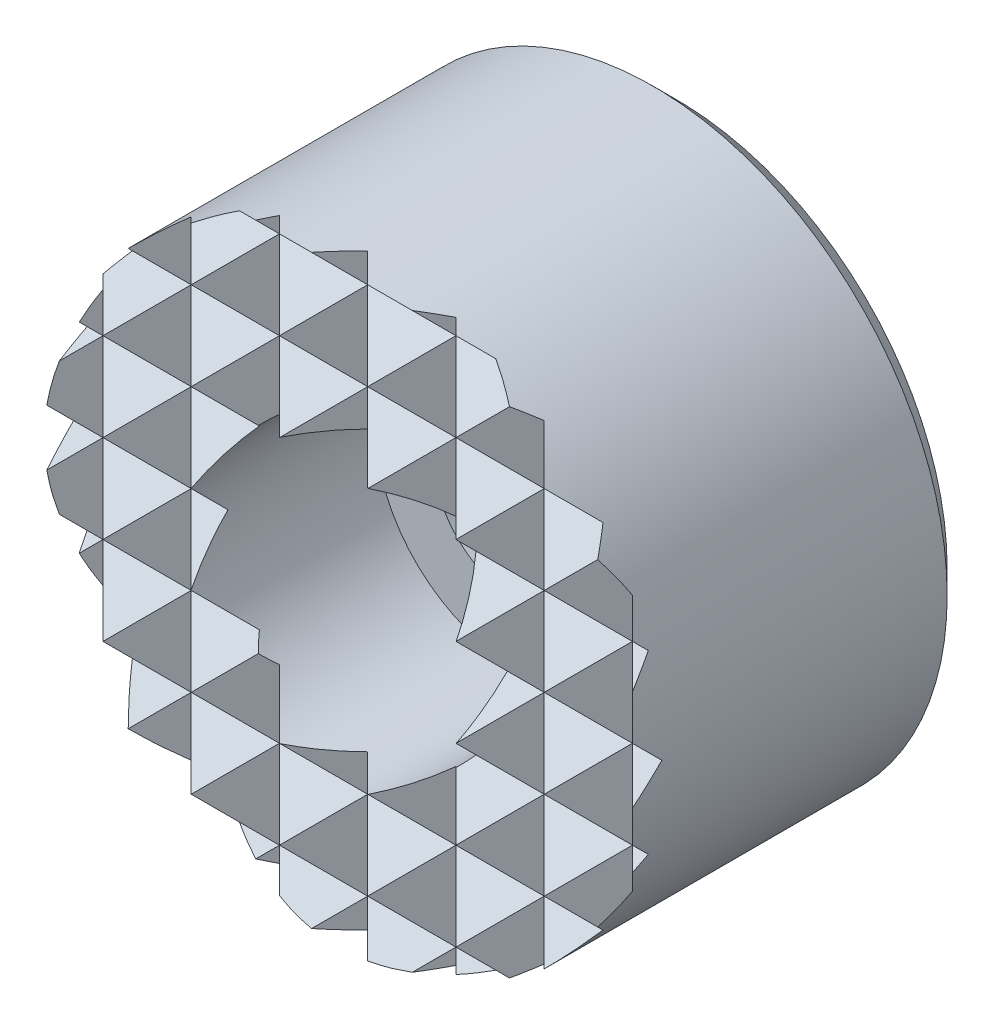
ISO-10303-21;
HEADER;
FILE_DESCRIPTION(('STEP AP214'),'2;1');
FILE_NAME('part.step','',(''),(''),'','','');
FILE_SCHEMA(('AUTOMOTIVE_DESIGN { 1 0 10303 214 1 1 1 1 }'));
ENDSEC;
DATA;
#1=APPLICATION_CONTEXT('core data for automotive mechanical design processes');
#2=APPLICATION_PROTOCOL_DEFINITION('international standard','automotive_design',2000,#1);
#3=PRODUCT_CONTEXT('',#1,'mechanical');
#4=PRODUCT('Part','Part','',(#3));
#5=PRODUCT_RELATED_PRODUCT_CATEGORY('part','',(#4));
#6=PRODUCT_DEFINITION_FORMATION('','',#4);
#7=PRODUCT_DEFINITION_CONTEXT('part definition',#1,'design');
#8=PRODUCT_DEFINITION('design','',#6,#7);
#9=PRODUCT_DEFINITION_SHAPE('','',#8);
#10=(LENGTH_UNIT() NAMED_UNIT(*) SI_UNIT(.MILLI.,.METRE.));
#11=(NAMED_UNIT(*) PLANE_ANGLE_UNIT() SI_UNIT($,.RADIAN.));
#12=(NAMED_UNIT(*) SI_UNIT($,.STERADIAN.) SOLID_ANGLE_UNIT());
#13=UNCERTAINTY_MEASURE_WITH_UNIT(LENGTH_MEASURE(1.E-05),#10,'distance_accuracy_value','');
#14=(GEOMETRIC_REPRESENTATION_CONTEXT(3) GLOBAL_UNCERTAINTY_ASSIGNED_CONTEXT((#13)) GLOBAL_UNIT_ASSIGNED_CONTEXT((#10,
#11,#12)) REPRESENTATION_CONTEXT('',''));
#15=CARTESIAN_POINT('',(0.,0.,0.));
#16=DIRECTION('',(0.,0.,1.));
#17=DIRECTION('',(1.,0.,0.));
#18=AXIS2_PLACEMENT_3D('',#15,#16,#17);
#19=CARTESIAN_POINT('',(6.,-15.,10.5));
#20=DIRECTION('',(0.707106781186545,0.,-0.70710678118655));
#21=DIRECTION('',(-0.70710678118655,0.,-0.707106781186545));
#22=AXIS2_PLACEMENT_3D('',#19,#20,#21);
#23=PLANE('',#22);
#24=CARTESIAN_POINT('',(0.,0.,4.50000000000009));
#25=DIRECTION('',(0.707106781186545,0.,-0.70710678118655));
#26=DIRECTION('',(-0.70710678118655,0.,-0.707106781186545));
#27=AXIS2_PLACEMENT_3D('',#24,#25,#26);
#28=ELLIPSE('',#27,14.1421356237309,10.);
#29=CARTESIAN_POINT('',(7.07106781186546,-7.07106781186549,11.5710678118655));
#30=VERTEX_POINT('',#29);
#31=CARTESIAN_POINT('',(6.,-8.,10.5));
#32=VERTEX_POINT('',#31);
#33=EDGE_CURVE('E644',#30,#32,#28,.T.);
#34=ORIENTED_EDGE('',*,*,#33,.F.);
#35=DIRECTION('',(-0.577350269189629,0.577350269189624,-0.577350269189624));
#36=VECTOR('',#35,1.);
#37=CARTESIAN_POINT('',(9.,-9.,13.5));
#38=LINE('',#37,#36);
#39=CARTESIAN_POINT('',(6.,-6.,10.5));
#40=VERTEX_POINT('',#39);
#41=EDGE_CURVE('E891',#30,#40,#38,.T.);
#42=ORIENTED_EDGE('',*,*,#41,.T.);
#43=DIRECTION('',(0.,1.,0.));
#44=VECTOR('',#43,1.);
#45=CARTESIAN_POINT('',(6.,-15.,10.5));
#46=LINE('',#45,#44);
#47=EDGE_CURVE('E538',#32,#40,#46,.T.);
#48=ORIENTED_EDGE('',*,*,#47,.F.);
#49=EDGE_LOOP('',(#34,#42,#48));
#50=FACE_BOUND('',#49,.T.);
#51=ADVANCED_FACE('F15',(#50),#23,.F.);
#52=CARTESIAN_POINT('',(6.,-3.,10.5));
#53=VERTEX_POINT('',#52);
#54=CARTESIAN_POINT('',(5.99999999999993,0.,10.5));
#55=VERTEX_POINT('',#54);
#56=EDGE_CURVE('E1328',#53,#55,#46,.T.);
#57=ORIENTED_EDGE('',*,*,#56,.F.);
#58=DIRECTION('',(0.577350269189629,0.577350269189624,0.577350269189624));
#59=VECTOR('',#58,1.);
#60=CARTESIAN_POINT('',(1.99999999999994,-7.,6.5));
#61=LINE('',#60,#59);
#62=CARTESIAN_POINT('',(7.5,-1.5,12.));
#63=VERTEX_POINT('',#62);
#64=EDGE_CURVE('E990',#53,#63,#61,.T.);
#65=ORIENTED_EDGE('',*,*,#64,.T.);
#66=DIRECTION('',(-0.577350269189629,0.577350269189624,-0.577350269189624));
#67=VECTOR('',#66,1.);
#68=CARTESIAN_POINT('',(11.,-5.,15.5));
#69=LINE('',#68,#67);
#70=EDGE_CURVE('E1015',#63,#55,#69,.T.);
#71=ORIENTED_EDGE('',*,*,#70,.T.);
#72=EDGE_LOOP('',(#57,#65,#71));
#73=FACE_BOUND('',#72,.T.);
#74=ADVANCED_FACE('F1290',(#73),#23,.F.);
#75=CARTESIAN_POINT('',(6.,6.,10.5));
#76=VERTEX_POINT('',#75);
#77=CARTESIAN_POINT('',(6.,8.,10.5));
#78=VERTEX_POINT('',#77);
#79=EDGE_CURVE('E541',#76,#78,#46,.T.);
#80=ORIENTED_EDGE('',*,*,#79,.F.);
#81=DIRECTION('',(0.577350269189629,0.577350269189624,0.577350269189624));
#82=VECTOR('',#81,1.);
#83=CARTESIAN_POINT('',(-1.00000000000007,-0.999999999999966,3.5));
#84=LINE('',#83,#82);
#85=CARTESIAN_POINT('',(7.07106781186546,7.07106781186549,11.5710678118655));
#86=VERTEX_POINT('',#85);
#87=EDGE_CURVE('E1198',#76,#86,#84,.T.);
#88=ORIENTED_EDGE('',*,*,#87,.T.);
#89=EDGE_CURVE('E640',#78,#86,#28,.T.);
#90=ORIENTED_EDGE('',*,*,#89,.F.);
#91=EDGE_LOOP('',(#80,#88,#90));
#92=FACE_BOUND('',#91,.T.);
#93=ADVANCED_FACE('F1225',(#92),#23,.F.);
#94=CARTESIAN_POINT('',(6.,3.,10.5));
#95=VERTEX_POINT('',#94);
#96=EDGE_CURVE('E1325',#55,#95,#46,.T.);
#97=ORIENTED_EDGE('',*,*,#96,.F.);
#98=DIRECTION('',(0.577350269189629,0.577350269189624,0.577350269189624));
#99=VECTOR('',#98,1.);
#100=CARTESIAN_POINT('',(0.999999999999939,-5.,5.5));
#101=LINE('',#100,#99);
#102=CARTESIAN_POINT('',(7.5,1.5,12.));
#103=VERTEX_POINT('',#102);
#104=EDGE_CURVE('E1038',#55,#103,#101,.T.);
#105=ORIENTED_EDGE('',*,*,#104,.T.);
#106=DIRECTION('',(-0.577350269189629,0.577350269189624,-0.577350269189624));
#107=VECTOR('',#106,1.);
#108=CARTESIAN_POINT('',(12.,-2.99999999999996,16.5));
#109=LINE('',#108,#107);
#110=EDGE_CURVE('E500',#103,#95,#109,.T.);
#111=ORIENTED_EDGE('',*,*,#110,.T.);
#112=EDGE_LOOP('',(#97,#105,#111));
#113=FACE_BOUND('',#112,.T.);
#114=ADVANCED_FACE('F1307',(#113),#23,.F.);
#115=CARTESIAN_POINT('',(7.5,-15.,12.));
#116=DIRECTION('',(-0.70710678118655,0.,-0.707106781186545));
#117=DIRECTION('',(-0.707106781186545,0.,0.70710678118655));
#118=AXIS2_PLACEMENT_3D('',#115,#116,#117);
#119=PLANE('',#118);
#120=DIRECTION('',(-0.577350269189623,-0.577350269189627,0.577350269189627));
#121=VECTOR('',#120,1.);
#122=CARTESIAN_POINT('',(4.,-8.,15.5));
#123=LINE('',#122,#121);
#124=CARTESIAN_POINT('',(9.,-3.,10.5));
#125=VERTEX_POINT('',#124);
#126=CARTESIAN_POINT('',(7.5,-4.5,12.));
#127=VERTEX_POINT('',#126);
#128=EDGE_CURVE('E964',#125,#127,#123,.T.);
#129=ORIENTED_EDGE('',*,*,#128,.T.);
#130=DIRECTION('',(0.577350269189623,-0.577350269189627,-0.577350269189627));
#131=VECTOR('',#130,1.);
#132=CARTESIAN_POINT('',(11.,-8.,8.5));
#133=LINE('',#132,#131);
#134=CARTESIAN_POINT('',(8.4101374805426,-5.41013748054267,11.0898625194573));
#135=VERTEX_POINT('',#134);
#136=EDGE_CURVE('E932',#127,#135,#133,.T.);
#137=ORIENTED_EDGE('',*,*,#136,.T.);
#138=CARTESIAN_POINT('',(0.,0.,19.5));
#139=DIRECTION('',(-0.70710678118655,0.,-0.707106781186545));
#140=DIRECTION('',(0.707106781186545,0.,-0.70710678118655));
#141=AXIS2_PLACEMENT_3D('',#138,#139,#140);
#142=ELLIPSE('',#141,14.142135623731,10.);
#143=CARTESIAN_POINT('',(9.,-4.35889894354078,10.5));
#144=VERTEX_POINT('',#143);
#145=EDGE_CURVE('E647',#144,#135,#142,.T.);
#146=ORIENTED_EDGE('',*,*,#145,.F.);
#147=DIRECTION('',(0.,1.,0.));
#148=VECTOR('',#147,1.);
#149=CARTESIAN_POINT('',(9.,-15.,10.5));
#150=LINE('',#149,#148);
#151=EDGE_CURVE('E542',#144,#125,#150,.T.);
#152=ORIENTED_EDGE('',*,*,#151,.T.);
#153=EDGE_LOOP('',(#129,#137,#146,#152));
#154=FACE_BOUND('',#153,.T.);
#155=ADVANCED_FACE('F1316',(#154),#119,.F.);
#156=DIRECTION('',(-0.577350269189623,-0.577350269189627,0.577350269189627));
#157=VECTOR('',#156,1.);
#158=CARTESIAN_POINT('',(3.,-6.,16.5));
#159=LINE('',#158,#157);
#160=CARTESIAN_POINT('',(9.,0.,10.5));
#161=VERTEX_POINT('',#160);
#162=EDGE_CURVE('E1018',#161,#63,#159,.T.);
#163=ORIENTED_EDGE('',*,*,#162,.T.);
#164=DIRECTION('',(0.577350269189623,-0.577350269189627,-0.577350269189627));
#165=VECTOR('',#164,1.);
#166=CARTESIAN_POINT('',(12.,-6.,7.5));
#167=LINE('',#166,#165);
#168=EDGE_CURVE('E30',#63,#125,#167,.T.);
#169=ORIENTED_EDGE('',*,*,#168,.T.);
#170=EDGE_CURVE('E545',#125,#161,#150,.T.);
#171=ORIENTED_EDGE('',*,*,#170,.T.);
#172=EDGE_LOOP('',(#163,#169,#171));
#173=FACE_BOUND('',#172,.T.);
#174=ADVANCED_FACE('F1322',(#173),#119,.F.);
#175=DIRECTION('',(-0.577350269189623,-0.577350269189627,0.577350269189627));
#176=VECTOR('',#175,1.);
#177=CARTESIAN_POINT('',(1.99999999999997,-4.,17.5));
#178=LINE('',#177,#176);
#179=CARTESIAN_POINT('',(9.,3.,10.5));
#180=VERTEX_POINT('',#179);
#181=EDGE_CURVE('E515',#180,#103,#178,.T.);
#182=ORIENTED_EDGE('',*,*,#181,.T.);
#183=DIRECTION('',(0.577350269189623,-0.577350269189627,-0.577350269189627));
#184=VECTOR('',#183,1.);
#185=CARTESIAN_POINT('',(13.,-4.,6.5));
#186=LINE('',#185,#184);
#187=EDGE_CURVE('E1041',#103,#161,#186,.T.);
#188=ORIENTED_EDGE('',*,*,#187,.T.);
#189=EDGE_CURVE('E1372',#161,#180,#150,.T.);
#190=ORIENTED_EDGE('',*,*,#189,.T.);
#191=EDGE_LOOP('',(#182,#188,#190));
#192=FACE_BOUND('',#191,.T.);
#193=ADVANCED_FACE('F1578',(#192),#119,.F.);
#194=CARTESIAN_POINT('',(9.,-15.,10.5));
#195=DIRECTION('',(0.707106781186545,0.,-0.70710678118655));
#196=DIRECTION('',(-0.70710678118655,0.,-0.707106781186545));
#197=AXIS2_PLACEMENT_3D('',#194,#195,#196);
#198=PLANE('',#197);
#199=ORIENTED_EDGE('',*,*,#189,.F.);
#200=DIRECTION('',(0.577350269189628,0.577350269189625,0.577350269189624));
#201=VECTOR('',#200,1.);
#202=CARTESIAN_POINT('',(3.99999999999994,-5.,5.5));
#203=LINE('',#202,#201);
#204=CARTESIAN_POINT('',(9.95435605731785,0.954356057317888,11.4543560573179));
#205=VERTEX_POINT('',#204);
#206=EDGE_CURVE('E1044',#161,#205,#203,.T.);
#207=ORIENTED_EDGE('',*,*,#206,.T.);
#208=CARTESIAN_POINT('',(0.,0.,1.50000000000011));
#209=DIRECTION('',(0.707106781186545,0.,-0.70710678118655));
#210=DIRECTION('',(-0.70710678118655,0.,-0.707106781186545));
#211=AXIS2_PLACEMENT_3D('',#208,#209,#210);
#212=ELLIPSE('',#211,14.1421356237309,10.);
#213=CARTESIAN_POINT('',(9.74165738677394,2.25834261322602,11.241657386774));
#214=VERTEX_POINT('',#213);
#215=EDGE_CURVE('E651',#214,#205,#212,.T.);
#216=ORIENTED_EDGE('',*,*,#215,.F.);
#217=DIRECTION('',(-0.577350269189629,0.577350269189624,-0.577350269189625));
#218=VECTOR('',#217,1.);
#219=CARTESIAN_POINT('',(15.,-2.99999999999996,16.5));
#220=LINE('',#219,#218);
#221=EDGE_CURVE('E507',#214,#180,#220,.T.);
#222=ORIENTED_EDGE('',*,*,#221,.T.);
#223=EDGE_LOOP('',(#199,#207,#216,#222));
#224=FACE_BOUND('',#223,.T.);
#225=ADVANCED_FACE('F1587',(#224),#198,.F.);
#226=CARTESIAN_POINT('',(9.95435605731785,-0.954356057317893,11.4543560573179));
#227=VERTEX_POINT('',#226);
#228=CARTESIAN_POINT('',(9.74165738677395,-2.25834261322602,11.241657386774));
#229=VERTEX_POINT('',#228);
#230=EDGE_CURVE('E1595',#227,#229,#212,.T.);
#231=ORIENTED_EDGE('',*,*,#230,.F.);
#232=DIRECTION('',(-0.577350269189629,0.577350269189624,-0.577350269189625));
#233=VECTOR('',#232,1.);
#234=CARTESIAN_POINT('',(14.,-5.,15.5));
#235=LINE('',#234,#233);
#236=EDGE_CURVE('E1021',#227,#161,#235,.T.);
#237=ORIENTED_EDGE('',*,*,#236,.T.);
#238=ORIENTED_EDGE('',*,*,#170,.F.);
#239=DIRECTION('',(0.577350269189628,0.577350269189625,0.577350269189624));
#240=VECTOR('',#239,1.);
#241=CARTESIAN_POINT('',(4.99999999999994,-7.,6.5));
#242=LINE('',#241,#240);
#243=EDGE_CURVE('E994',#125,#229,#242,.T.);
#244=ORIENTED_EDGE('',*,*,#243,.T.);
#245=EDGE_LOOP('',(#231,#237,#238,#244));
#246=FACE_BOUND('',#245,.T.);
#247=ADVANCED_FACE('F1369',(#246),#198,.F.);
#248=CARTESIAN_POINT('',(9.40312423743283,-3.40312423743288,10.9031242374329));
#249=VERTEX_POINT('',#248);
#250=EDGE_CURVE('E646',#249,#144,#212,.T.);
#251=ORIENTED_EDGE('',*,*,#250,.F.);
#252=DIRECTION('',(-0.577350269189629,0.577350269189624,-0.577350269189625));
#253=VECTOR('',#252,1.);
#254=CARTESIAN_POINT('',(13.,-7.,14.5));
#255=LINE('',#254,#253);
#256=EDGE_CURVE('E967',#249,#125,#255,.T.);
#257=ORIENTED_EDGE('',*,*,#256,.T.);
#258=ORIENTED_EDGE('',*,*,#151,.F.);
#259=EDGE_LOOP('',(#251,#257,#258));
#260=FACE_BOUND('',#259,.T.);
#261=ADVANCED_FACE('F1361',(#260),#198,.F.);
#262=CARTESIAN_POINT('',(-10.5,-15.,12.));
#263=DIRECTION('',(-0.70710678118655,0.,-0.707106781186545));
#264=DIRECTION('',(-0.707106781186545,0.,0.70710678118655));
#265=AXIS2_PLACEMENT_3D('',#262,#263,#264);
#266=PLANE('',#265);
#267=CARTESIAN_POINT('',(0.,0.,1.5));
#268=DIRECTION('',(-0.70710678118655,0.,-0.707106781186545));
#269=DIRECTION('',(0.707106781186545,0.,-0.70710678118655));
#270=AXIS2_PLACEMENT_3D('',#267,#268,#269);
#271=ELLIPSE('',#270,14.142135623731,10.);
#272=CARTESIAN_POINT('',(-9.95435605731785,0.954356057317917,11.4543560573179));
#273=VERTEX_POINT('',#272);
#274=CARTESIAN_POINT('',(-9.74165738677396,2.25834261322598,11.241657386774));
#275=VERTEX_POINT('',#274);
#276=EDGE_CURVE('E494',#273,#275,#271,.T.);
#277=ORIENTED_EDGE('',*,*,#276,.F.);
#278=DIRECTION('',(0.577350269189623,-0.577350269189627,-0.577350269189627));
#279=VECTOR('',#278,1.);
#280=CARTESIAN_POINT('',(-5.,-4.,6.5));
#281=LINE('',#280,#279);
#282=CARTESIAN_POINT('',(-9.,0.,10.5));
#283=VERTEX_POINT('',#282);
#284=EDGE_CURVE('E1025',#273,#283,#281,.T.);
#285=ORIENTED_EDGE('',*,*,#284,.T.);
#286=DIRECTION('',(0.,1.,0.));
#287=VECTOR('',#286,1.);
#288=CARTESIAN_POINT('',(-9.,-15.,10.5));
#289=LINE('',#288,#287);
#290=CARTESIAN_POINT('',(-9.,3.,10.5));
#291=VERTEX_POINT('',#290);
#292=EDGE_CURVE('E1055',#283,#291,#289,.T.);
#293=ORIENTED_EDGE('',*,*,#292,.T.);
#294=DIRECTION('',(-0.577350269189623,-0.577350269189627,0.577350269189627));
#295=VECTOR('',#294,1.);
#296=CARTESIAN_POINT('',(-16.,-4.,17.5));
#297=LINE('',#296,#295);
#298=EDGE_CURVE('E483',#291,#275,#297,.T.);
#299=ORIENTED_EDGE('',*,*,#298,.T.);
#300=EDGE_LOOP('',(#277,#285,#293,#299));
#301=FACE_BOUND('',#300,.T.);
#302=ADVANCED_FACE('F1053',(#301),#266,.F.);
#303=CARTESIAN_POINT('',(-9.,-3.,10.5));
#304=VERTEX_POINT('',#303);
#305=EDGE_CURVE('E550',#304,#283,#289,.T.);
#306=ORIENTED_EDGE('',*,*,#305,.T.);
#307=DIRECTION('',(-0.577350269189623,-0.577350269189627,0.577350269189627));
#308=VECTOR('',#307,1.);
#309=CARTESIAN_POINT('',(-15.,-6.,16.5));
#310=LINE('',#309,#308);
#311=CARTESIAN_POINT('',(-9.95435605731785,-0.954356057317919,11.4543560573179));
#312=VERTEX_POINT('',#311);
#313=EDGE_CURVE('E1003',#283,#312,#310,.T.);
#314=ORIENTED_EDGE('',*,*,#313,.T.);
#315=CARTESIAN_POINT('',(-9.74165738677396,-2.25834261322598,11.241657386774));
#316=VERTEX_POINT('',#315);
#317=EDGE_CURVE('E639',#316,#312,#271,.T.);
#318=ORIENTED_EDGE('',*,*,#317,.F.);
#319=DIRECTION('',(0.577350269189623,-0.577350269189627,-0.577350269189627));
#320=VECTOR('',#319,1.);
#321=CARTESIAN_POINT('',(-6.,-6.,7.5));
#322=LINE('',#321,#320);
#323=EDGE_CURVE('E976',#316,#304,#322,.T.);
#324=ORIENTED_EDGE('',*,*,#323,.T.);
#325=EDGE_LOOP('',(#306,#314,#318,#324));
#326=FACE_BOUND('',#325,.T.);
#327=ADVANCED_FACE('F1075',(#326),#266,.F.);
#328=CARTESIAN_POINT('',(-9.,-4.35889894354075,10.5));
#329=VERTEX_POINT('',#328);
#330=EDGE_CURVE('E547',#329,#304,#289,.T.);
#331=ORIENTED_EDGE('',*,*,#330,.T.);
#332=DIRECTION('',(-0.577350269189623,-0.577350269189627,0.577350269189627));
#333=VECTOR('',#332,1.);
#334=CARTESIAN_POINT('',(-14.,-8.,15.5));
#335=LINE('',#334,#333);
#336=CARTESIAN_POINT('',(-9.40312423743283,-3.4031242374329,10.9031242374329));
#337=VERTEX_POINT('',#336);
#338=EDGE_CURVE('E944',#304,#337,#335,.T.);
#339=ORIENTED_EDGE('',*,*,#338,.T.);
#340=EDGE_CURVE('E636',#329,#337,#271,.T.);
#341=ORIENTED_EDGE('',*,*,#340,.F.);
#342=EDGE_LOOP('',(#331,#339,#341));
#343=FACE_BOUND('',#342,.T.);
#344=ADVANCED_FACE('F1740',(#343),#266,.F.);
#345=CARTESIAN_POINT('',(-9.,-15.,10.5));
#346=DIRECTION('',(0.707106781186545,0.,-0.707106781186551));
#347=DIRECTION('',(-0.707106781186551,0.,-0.707106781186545));
#348=AXIS2_PLACEMENT_3D('',#345,#346,#347);
#349=PLANE('',#348);
#350=CARTESIAN_POINT('',(0.,0.,19.5));
#351=DIRECTION('',(0.707106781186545,0.,-0.707106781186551));
#352=DIRECTION('',(-0.707106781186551,0.,-0.707106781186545));
#353=AXIS2_PLACEMENT_3D('',#350,#351,#352);
#354=ELLIPSE('',#353,14.1421356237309,10.);
#355=CARTESIAN_POINT('',(-8.41013748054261,-5.41013748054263,11.0898625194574));
#356=VERTEX_POINT('',#355);
#357=EDGE_CURVE('E635',#356,#329,#354,.T.);
#358=ORIENTED_EDGE('',*,*,#357,.F.);
#359=DIRECTION('',(0.577350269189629,0.577350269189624,0.577350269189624));
#360=VECTOR('',#359,1.);
#361=CARTESIAN_POINT('',(-12.,-9.,7.5));
#362=LINE('',#361,#360);
#363=CARTESIAN_POINT('',(-7.5,-4.5,12.));
#364=VERTEX_POINT('',#363);
#365=EDGE_CURVE('E903',#356,#364,#362,.T.);
#366=ORIENTED_EDGE('',*,*,#365,.T.);
#367=DIRECTION('',(-0.577350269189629,0.577350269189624,-0.577350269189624));
#368=VECTOR('',#367,1.);
#369=CARTESIAN_POINT('',(-5.,-7.,14.5));
#370=LINE('',#369,#368);
#371=EDGE_CURVE('E941',#364,#304,#370,.T.);
#372=ORIENTED_EDGE('',*,*,#371,.T.);
#373=ORIENTED_EDGE('',*,*,#330,.F.);
#374=EDGE_LOOP('',(#358,#366,#372,#373));
#375=FACE_BOUND('',#374,.T.);
#376=ADVANCED_FACE('F1284',(#375),#349,.F.);
#377=ORIENTED_EDGE('',*,*,#305,.F.);
#378=DIRECTION('',(0.577350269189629,0.577350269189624,0.577350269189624));
#379=VECTOR('',#378,1.);
#380=CARTESIAN_POINT('',(-13.,-7.,6.5));
#381=LINE('',#380,#379);
#382=CARTESIAN_POINT('',(-7.5,-1.5,12.));
#383=VERTEX_POINT('',#382);
#384=EDGE_CURVE('E973',#304,#383,#381,.T.);
#385=ORIENTED_EDGE('',*,*,#384,.T.);
#386=DIRECTION('',(-0.577350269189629,0.577350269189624,-0.577350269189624));
#387=VECTOR('',#386,1.);
#388=CARTESIAN_POINT('',(-4.,-5.,15.5));
#389=LINE('',#388,#387);
#390=EDGE_CURVE('E1000',#383,#283,#389,.T.);
#391=ORIENTED_EDGE('',*,*,#390,.T.);
#392=EDGE_LOOP('',(#377,#385,#391));
#393=FACE_BOUND('',#392,.T.);
#394=ADVANCED_FACE('F1272',(#393),#349,.F.);
#395=ORIENTED_EDGE('',*,*,#292,.F.);
#396=DIRECTION('',(0.577350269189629,0.577350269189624,0.577350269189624));
#397=VECTOR('',#396,1.);
#398=CARTESIAN_POINT('',(-14.,-5.,5.5));
#399=LINE('',#398,#397);
#400=CARTESIAN_POINT('',(-7.5,1.5,12.));
#401=VERTEX_POINT('',#400);
#402=EDGE_CURVE('E711',#283,#401,#399,.T.);
#403=ORIENTED_EDGE('',*,*,#402,.T.);
#404=DIRECTION('',(-0.577350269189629,0.577350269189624,-0.577350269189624));
#405=VECTOR('',#404,1.);
#406=CARTESIAN_POINT('',(-2.99999999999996,-3.,16.5));
#407=LINE('',#406,#405);
#408=EDGE_CURVE('E1048',#401,#291,#407,.T.);
#409=ORIENTED_EDGE('',*,*,#408,.T.);
#410=EDGE_LOOP('',(#395,#403,#409));
#411=FACE_BOUND('',#410,.T.);
#412=ADVANCED_FACE('F1269',(#411),#349,.F.);
#413=CARTESIAN_POINT('',(-7.5,-15.,12.));
#414=DIRECTION('',(-0.70710678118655,0.,-0.707106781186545));
#415=DIRECTION('',(-0.707106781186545,0.,0.70710678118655));
#416=AXIS2_PLACEMENT_3D('',#413,#414,#415);
#417=PLANE('',#416);
#418=DIRECTION('',(0.,1.,0.));
#419=VECTOR('',#418,1.);
#420=CARTESIAN_POINT('',(-6.,-15.,10.5));
#421=LINE('',#420,#419);
#422=CARTESIAN_POINT('',(-6.,-8.,10.5));
#423=VERTEX_POINT('',#422);
#424=CARTESIAN_POINT('',(-6.,-6.,10.5));
#425=VERTEX_POINT('',#424);
#426=EDGE_CURVE('E552',#423,#425,#421,.T.);
#427=ORIENTED_EDGE('',*,*,#426,.T.);
#428=DIRECTION('',(-0.577350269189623,-0.577350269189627,0.577350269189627));
#429=VECTOR('',#428,1.);
#430=CARTESIAN_POINT('',(-10.,-10.,14.5));
#431=LINE('',#430,#429);
#432=CARTESIAN_POINT('',(-7.07106781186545,-7.07106781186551,11.5710678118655));
#433=VERTEX_POINT('',#432);
#434=EDGE_CURVE('E871',#425,#433,#431,.T.);
#435=ORIENTED_EDGE('',*,*,#434,.T.);
#436=CARTESIAN_POINT('',(0.,0.,4.5));
#437=DIRECTION('',(-0.70710678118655,0.,-0.707106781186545));
#438=DIRECTION('',(0.707106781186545,0.,-0.70710678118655));
#439=AXIS2_PLACEMENT_3D('',#436,#437,#438);
#440=ELLIPSE('',#439,14.142135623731,10.);
#441=EDGE_CURVE('E631',#423,#433,#440,.T.);
#442=ORIENTED_EDGE('',*,*,#441,.F.);
#443=EDGE_LOOP('',(#427,#435,#442));
#444=FACE_BOUND('',#443,.T.);
#445=ADVANCED_FACE('F1271',(#444),#417,.F.);
#446=DIRECTION('',(-0.577350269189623,-0.577350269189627,0.577350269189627));
#447=VECTOR('',#446,1.);
#448=CARTESIAN_POINT('',(-12.,-6.,16.5));
#449=LINE('',#448,#447);
#450=CARTESIAN_POINT('',(-6.,0.,10.5));
#451=VERTEX_POINT('',#450);
#452=EDGE_CURVE('E997',#451,#383,#449,.T.);
#453=ORIENTED_EDGE('',*,*,#452,.T.);
#454=DIRECTION('',(0.577350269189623,-0.577350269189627,-0.577350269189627));
#455=VECTOR('',#454,1.);
#456=CARTESIAN_POINT('',(-2.99999999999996,-6.,7.5));
#457=LINE('',#456,#455);
#458=CARTESIAN_POINT('',(-6.,-3.,10.5));
#459=VERTEX_POINT('',#458);
#460=EDGE_CURVE('E970',#383,#459,#457,.T.);
#461=ORIENTED_EDGE('',*,*,#460,.T.);
#462=EDGE_CURVE('E692',#459,#451,#421,.T.);
#463=ORIENTED_EDGE('',*,*,#462,.T.);
#464=EDGE_LOOP('',(#453,#461,#463));
#465=FACE_BOUND('',#464,.T.);
#466=ADVANCED_FACE('F1279',(#465),#417,.F.);
#467=CARTESIAN_POINT('',(-7.07106781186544,7.07106781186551,11.5710678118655));
#468=VERTEX_POINT('',#467);
#469=CARTESIAN_POINT('',(-6.,8.,10.5));
#470=VERTEX_POINT('',#469);
#471=EDGE_CURVE('E628',#468,#470,#440,.T.);
#472=ORIENTED_EDGE('',*,*,#471,.F.);
#473=DIRECTION('',(0.577350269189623,-0.577350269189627,-0.577350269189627));
#474=VECTOR('',#473,1.);
#475=CARTESIAN_POINT('',(0.,0.,4.5));
#476=LINE('',#475,#474);
#477=CARTESIAN_POINT('',(-6.,6.,10.5));
#478=VERTEX_POINT('',#477);
#479=EDGE_CURVE('E1178',#468,#478,#476,.T.);
#480=ORIENTED_EDGE('',*,*,#479,.T.);
#481=EDGE_CURVE('E555',#478,#470,#421,.T.);
#482=ORIENTED_EDGE('',*,*,#481,.T.);
#483=EDGE_LOOP('',(#472,#480,#482));
#484=FACE_BOUND('',#483,.T.);
#485=ADVANCED_FACE('F1532',(#484),#417,.F.);
#486=DIRECTION('',(-0.577350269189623,-0.577350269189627,0.577350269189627));
#487=VECTOR('',#486,1.);
#488=CARTESIAN_POINT('',(-13.,-4.,17.5));
#489=LINE('',#488,#487);
#490=CARTESIAN_POINT('',(-6.,3.,10.5));
#491=VERTEX_POINT('',#490);
#492=EDGE_CURVE('E706',#491,#401,#489,.T.);
#493=ORIENTED_EDGE('',*,*,#492,.T.);
#494=DIRECTION('',(0.577350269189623,-0.577350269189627,-0.577350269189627));
#495=VECTOR('',#494,1.);
#496=CARTESIAN_POINT('',(-1.99999999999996,-4.,6.5));
#497=LINE('',#496,#495);
#498=EDGE_CURVE('E700',#401,#451,#497,.T.);
#499=ORIENTED_EDGE('',*,*,#498,.T.);
#500=EDGE_CURVE('E703',#451,#491,#421,.T.);
#501=ORIENTED_EDGE('',*,*,#500,.T.);
#502=EDGE_LOOP('',(#493,#499,#501));
#503=FACE_BOUND('',#502,.T.);
#504=ADVANCED_FACE('F702',(#503),#417,.F.);
#505=CARTESIAN_POINT('',(-2.99999999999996,-15.,10.5));
#506=DIRECTION('',(0.707106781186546,0.,-0.70710678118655));
#507=DIRECTION('',(-0.70710678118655,0.,-0.707106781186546));
#508=AXIS2_PLACEMENT_3D('',#505,#506,#507);
#509=PLANE('',#508);
#510=DIRECTION('',(0.,1.,0.));
#511=VECTOR('',#510,1.);
#512=CARTESIAN_POINT('',(-2.99999999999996,-15.,10.5));
#513=LINE('',#512,#511);
#514=CARTESIAN_POINT('',(-2.99999999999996,9.,10.5));
#515=VERTEX_POINT('',#514);
#516=CARTESIAN_POINT('',(-2.99999999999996,9.53939201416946,10.5));
#517=VERTEX_POINT('',#516);
#518=EDGE_CURVE('E506',#515,#517,#513,.T.);
#519=ORIENTED_EDGE('',*,*,#518,.F.);
#520=DIRECTION('',(0.577350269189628,0.577350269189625,0.577350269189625));
#521=VECTOR('',#520,1.);
#522=CARTESIAN_POINT('',(-11.,1.00000000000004,2.50000000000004));
#523=LINE('',#522,#521);
#524=CARTESIAN_POINT('',(-2.25834261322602,9.74165738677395,11.2416573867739));
#525=VERTEX_POINT('',#524);
#526=EDGE_CURVE('E775',#515,#525,#523,.T.);
#527=ORIENTED_EDGE('',*,*,#526,.T.);
#528=CARTESIAN_POINT('',(0.,0.,13.5));
#529=DIRECTION('',(0.707106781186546,0.,-0.70710678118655));
#530=DIRECTION('',(-0.70710678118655,0.,-0.707106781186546));
#531=AXIS2_PLACEMENT_3D('',#528,#529,#530);
#532=ELLIPSE('',#531,14.1421356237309,10.);
#533=EDGE_CURVE('E583',#517,#525,#532,.T.);
#534=ORIENTED_EDGE('',*,*,#533,.F.);
#535=EDGE_LOOP('',(#519,#527,#534));
#536=FACE_BOUND('',#535,.T.);
#537=ADVANCED_FACE('F789',(#536),#509,.F.);
#538=CARTESIAN_POINT('',(-2.99999999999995,-6.,10.5));
#539=VERTEX_POINT('',#538);
#540=CARTESIAN_POINT('',(-2.99999999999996,-3.6827299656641,10.5));
#541=VERTEX_POINT('',#540);
#542=EDGE_CURVE('E558',#539,#541,#513,.T.);
#543=ORIENTED_EDGE('',*,*,#542,.F.);
#544=DIRECTION('',(0.577350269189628,0.577350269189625,0.577350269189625));
#545=VECTOR('',#544,1.);
#546=CARTESIAN_POINT('',(-6.,-9.,7.5));
#547=LINE('',#546,#545);
#548=CARTESIAN_POINT('',(-1.5052038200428,-4.50520382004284,11.9947961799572));
#549=VERTEX_POINT('',#548);
#550=EDGE_CURVE('E897',#539,#549,#547,.T.);
#551=ORIENTED_EDGE('',*,*,#550,.T.);
#552=CARTESIAN_POINT('',(0.,0.,13.5));
#553=DIRECTION('',(0.707106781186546,0.,-0.70710678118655));
#554=DIRECTION('',(0.70710678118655,0.,0.707106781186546));
#555=AXIS2_PLACEMENT_3D('',#552,#553,#554);
#556=ELLIPSE('',#555,6.71751442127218,4.75);
#557=EDGE_CURVE('E609',#541,#549,#556,.F.);
#558=ORIENTED_EDGE('',*,*,#557,.F.);
#559=EDGE_LOOP('',(#543,#551,#558));
#560=FACE_BOUND('',#559,.T.);
#561=ADVANCED_FACE('F1863',(#560),#509,.F.);
#562=CARTESIAN_POINT('',(-1.49999999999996,-15.,12.));
#563=DIRECTION('',(-0.70710678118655,0.,-0.707106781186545));
#564=DIRECTION('',(-0.707106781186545,0.,0.70710678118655));
#565=AXIS2_PLACEMENT_3D('',#562,#563,#564);
#566=PLANE('',#565);
#567=CARTESIAN_POINT('',(0.,0.,10.5));
#568=DIRECTION('',(-0.70710678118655,0.,-0.707106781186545));
#569=DIRECTION('',(-0.707106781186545,0.,0.70710678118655));
#570=AXIS2_PLACEMENT_3D('',#567,#568,#569);
#571=ELLIPSE('',#570,6.71751442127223,4.75);
#572=CARTESIAN_POINT('',(-1.48961925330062,-4.51038074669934,11.9896192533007));
#573=VERTEX_POINT('',#572);
#574=CARTESIAN_POINT('',(0.,-4.75,10.5));
#575=VERTEX_POINT('',#574);
#576=EDGE_CURVE('E613',#573,#575,#571,.F.);
#577=ORIENTED_EDGE('',*,*,#576,.F.);
#578=DIRECTION('',(0.577350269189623,-0.577350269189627,-0.577350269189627));
#579=VECTOR('',#578,1.);
#580=CARTESIAN_POINT('',(2.00000000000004,-8.,8.5));
#581=LINE('',#580,#579);
#582=CARTESIAN_POINT('',(0.,-6.,10.5));
#583=VERTEX_POINT('',#582);
#584=EDGE_CURVE('E913',#573,#583,#581,.T.);
#585=ORIENTED_EDGE('',*,*,#584,.T.);
#586=DIRECTION('',(0.,1.,0.));
#587=VECTOR('',#586,1.);
#588=CARTESIAN_POINT('',(0.,-15.,10.5));
#589=LINE('',#588,#587);
#590=EDGE_CURVE('E527',#583,#575,#589,.T.);
#591=ORIENTED_EDGE('',*,*,#590,.T.);
#592=EDGE_LOOP('',(#577,#585,#591));
#593=FACE_BOUND('',#592,.T.);
#594=ADVANCED_FACE('F1871',(#593),#566,.F.);
#595=CARTESIAN_POINT('',(0.,0.,10.5));
#596=DIRECTION('',(-0.70710678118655,0.,-0.707106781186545));
#597=DIRECTION('',(0.707106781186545,0.,-0.70710678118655));
#598=AXIS2_PLACEMENT_3D('',#595,#596,#597);
#599=ELLIPSE('',#598,14.142135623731,10.);
#600=CARTESIAN_POINT('',(-0.954356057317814,9.95435605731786,11.4543560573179));
#601=VERTEX_POINT('',#600);
#602=CARTESIAN_POINT('',(0.,10.,10.5));
#603=VERTEX_POINT('',#602);
#604=EDGE_CURVE('E578',#601,#603,#599,.T.);
#605=ORIENTED_EDGE('',*,*,#604,.F.);
#606=DIRECTION('',(0.577350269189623,-0.577350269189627,-0.577350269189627));
#607=VECTOR('',#606,1.);
#608=CARTESIAN_POINT('',(7.,1.99999999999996,3.49999999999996));
#609=LINE('',#608,#607);
#610=CARTESIAN_POINT('',(0.,9.,10.5));
#611=VERTEX_POINT('',#610);
#612=EDGE_CURVE('E794',#601,#611,#609,.T.);
#613=ORIENTED_EDGE('',*,*,#612,.T.);
#614=EDGE_CURVE('E529',#611,#603,#589,.T.);
#615=ORIENTED_EDGE('',*,*,#614,.T.);
#616=EDGE_LOOP('',(#605,#613,#615));
#617=FACE_BOUND('',#616,.T.);
#618=ADVANCED_FACE('F1881',(#617),#566,.F.);
#619=CARTESIAN_POINT('',(0.,-15.,10.5));
#620=DIRECTION('',(0.707106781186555,0.,-0.70710678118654));
#621=DIRECTION('',(-0.70710678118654,0.,-0.707106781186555));
#622=AXIS2_PLACEMENT_3D('',#619,#620,#621);
#623=PLANE('',#622);
#624=ORIENTED_EDGE('',*,*,#614,.F.);
#625=DIRECTION('',(0.577350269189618,0.57735026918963,0.57735026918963));
#626=VECTOR('',#625,1.);
#627=CARTESIAN_POINT('',(-7.99999999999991,0.99999999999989,2.49999999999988));
#628=LINE('',#627,#626);
#629=CARTESIAN_POINT('',(0.954356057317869,9.95435605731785,11.4543560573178));
#630=VERTEX_POINT('',#629);
#631=EDGE_CURVE('E798',#611,#630,#628,.T.);
#632=ORIENTED_EDGE('',*,*,#631,.T.);
#633=CARTESIAN_POINT('',(0.,0.,10.5));
#634=DIRECTION('',(0.707106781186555,0.,-0.70710678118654));
#635=DIRECTION('',(-0.70710678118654,0.,-0.707106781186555));
#636=AXIS2_PLACEMENT_3D('',#633,#634,#635);
#637=ELLIPSE('',#636,14.1421356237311,10.);
#638=EDGE_CURVE('E577',#603,#630,#637,.T.);
#639=ORIENTED_EDGE('',*,*,#638,.F.);
#640=EDGE_LOOP('',(#624,#632,#639));
#641=FACE_BOUND('',#640,.T.);
#642=ADVANCED_FACE('F1892',(#641),#623,.F.);
#643=ORIENTED_EDGE('',*,*,#590,.F.);
#644=DIRECTION('',(0.577350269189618,0.57735026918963,0.57735026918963));
#645=VECTOR('',#644,1.);
#646=CARTESIAN_POINT('',(-2.99999999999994,-9.,7.5));
#647=LINE('',#646,#645);
#648=CARTESIAN_POINT('',(1.4896192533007,-4.51038074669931,11.9896192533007));
#649=VERTEX_POINT('',#648);
#650=EDGE_CURVE('E917',#583,#649,#647,.T.);
#651=ORIENTED_EDGE('',*,*,#650,.T.);
#652=CARTESIAN_POINT('',(0.,0.,10.5));
#653=DIRECTION('',(0.707106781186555,0.,-0.70710678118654));
#654=DIRECTION('',(0.70710678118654,0.,0.707106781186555));
#655=AXIS2_PLACEMENT_3D('',#652,#653,#654);
#656=ELLIPSE('',#655,6.71751442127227,4.75);
#657=EDGE_CURVE('E616',#575,#649,#656,.F.);
#658=ORIENTED_EDGE('',*,*,#657,.F.);
#659=EDGE_LOOP('',(#643,#651,#658));
#660=FACE_BOUND('',#659,.T.);
#661=ADVANCED_FACE('F1902',(#660),#623,.F.);
#662=CARTESIAN_POINT('',(1.5,-15.,12.));
#663=DIRECTION('',(-0.70710678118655,0.,-0.707106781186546));
#664=DIRECTION('',(-0.707106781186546,0.,0.70710678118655));
#665=AXIS2_PLACEMENT_3D('',#662,#663,#664);
#666=PLANE('',#665);
#667=CARTESIAN_POINT('',(0.,0.,13.5));
#668=DIRECTION('',(-0.70710678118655,0.,-0.707106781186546));
#669=DIRECTION('',(-0.707106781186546,0.,0.70710678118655));
#670=AXIS2_PLACEMENT_3D('',#667,#668,#669);
#671=ELLIPSE('',#670,6.71751442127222,4.75);
#672=CARTESIAN_POINT('',(1.50520382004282,-4.50520382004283,11.9947961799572));
#673=VERTEX_POINT('',#672);
#674=CARTESIAN_POINT('',(3.,-3.68272996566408,10.5));
#675=VERTEX_POINT('',#674);
#676=EDGE_CURVE('E620',#673,#675,#671,.F.);
#677=ORIENTED_EDGE('',*,*,#676,.F.);
#678=DIRECTION('',(0.577350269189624,-0.577350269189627,-0.577350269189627));
#679=VECTOR('',#678,1.);
#680=CARTESIAN_POINT('',(5.,-8.,8.5));
#681=LINE('',#680,#679);
#682=CARTESIAN_POINT('',(2.99999999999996,-6.,10.5));
#683=VERTEX_POINT('',#682);
#684=EDGE_CURVE('E920',#673,#683,#681,.T.);
#685=ORIENTED_EDGE('',*,*,#684,.T.);
#686=DIRECTION('',(0.,1.,0.));
#687=VECTOR('',#686,1.);
#688=CARTESIAN_POINT('',(3.,-15.,10.5));
#689=LINE('',#688,#687);
#690=EDGE_CURVE('E534',#683,#675,#689,.T.);
#691=ORIENTED_EDGE('',*,*,#690,.T.);
#692=EDGE_LOOP('',(#677,#685,#691));
#693=FACE_BOUND('',#692,.T.);
#694=ADVANCED_FACE('F1657',(#693),#666,.F.);
#695=CARTESIAN_POINT('',(0.,0.,13.5));
#696=DIRECTION('',(-0.70710678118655,0.,-0.707106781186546));
#697=DIRECTION('',(0.707106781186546,0.,-0.70710678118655));
#698=AXIS2_PLACEMENT_3D('',#695,#696,#697);
#699=ELLIPSE('',#698,14.142135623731,10.);
#700=CARTESIAN_POINT('',(2.25834261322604,9.74165738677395,11.2416573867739));
#701=VERTEX_POINT('',#700);
#702=CARTESIAN_POINT('',(3.,9.53939201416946,10.5));
#703=VERTEX_POINT('',#702);
#704=EDGE_CURVE('E572',#701,#703,#699,.T.);
#705=ORIENTED_EDGE('',*,*,#704,.F.);
#706=DIRECTION('',(0.577350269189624,-0.577350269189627,-0.577350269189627));
#707=VECTOR('',#706,1.);
#708=CARTESIAN_POINT('',(10.,1.99999999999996,3.49999999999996));
#709=LINE('',#708,#707);
#710=CARTESIAN_POINT('',(2.99999999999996,9.,10.5));
#711=VERTEX_POINT('',#710);
#712=EDGE_CURVE('E802',#701,#711,#709,.T.);
#713=ORIENTED_EDGE('',*,*,#712,.T.);
#714=EDGE_CURVE('E536',#711,#703,#689,.T.);
#715=ORIENTED_EDGE('',*,*,#714,.T.);
#716=EDGE_LOOP('',(#705,#713,#715));
#717=FACE_BOUND('',#716,.T.);
#718=ADVANCED_FACE('F1644',(#717),#666,.F.);
#719=CARTESIAN_POINT('',(3.,-15.,10.5));
#720=DIRECTION('',(0.707106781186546,0.,-0.707106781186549));
#721=DIRECTION('',(-0.707106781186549,0.,-0.707106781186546));
#722=AXIS2_PLACEMENT_3D('',#719,#720,#721);
#723=PLANE('',#722);
#724=ORIENTED_EDGE('',*,*,#714,.F.);
#725=DIRECTION('',(0.577350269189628,0.577350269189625,0.577350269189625));
#726=VECTOR('',#725,1.);
#727=CARTESIAN_POINT('',(-5.,1.00000000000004,2.5));
#728=LINE('',#727,#726);
#729=CARTESIAN_POINT('',(3.40312423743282,9.40312423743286,10.9031242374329));
#730=VERTEX_POINT('',#729);
#731=EDGE_CURVE('E806',#711,#730,#728,.T.);
#732=ORIENTED_EDGE('',*,*,#731,.T.);
#733=CARTESIAN_POINT('',(0.,0.,7.5));
#734=DIRECTION('',(0.707106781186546,0.,-0.707106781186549));
#735=DIRECTION('',(-0.707106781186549,0.,-0.707106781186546));
#736=AXIS2_PLACEMENT_3D('',#733,#734,#735);
#737=ELLIPSE('',#736,14.1421356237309,10.);
#738=EDGE_CURVE('E571',#703,#730,#737,.T.);
#739=ORIENTED_EDGE('',*,*,#738,.F.);
#740=EDGE_LOOP('',(#724,#732,#739));
#741=FACE_BOUND('',#740,.T.);
#742=ADVANCED_FACE('F1645',(#741),#723,.F.);
#743=DIRECTION('',(0.577350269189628,0.577350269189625,0.577350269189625));
#744=VECTOR('',#743,1.);
#745=CARTESIAN_POINT('',(0.,-9.,7.5));
#746=LINE('',#745,#744);
#747=CARTESIAN_POINT('',(4.49999999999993,-4.5,12.));
#748=VERTEX_POINT('',#747);
#749=EDGE_CURVE('E923',#683,#748,#746,.T.);
#750=ORIENTED_EDGE('',*,*,#749,.T.);
#751=DIRECTION('',(-0.577350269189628,0.577350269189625,-0.577350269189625));
#752=VECTOR('',#751,1.);
#753=CARTESIAN_POINT('',(7.,-7.,14.5));
#754=LINE('',#753,#752);
#755=CARTESIAN_POINT('',(3.35875721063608,-3.35875721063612,10.8587572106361));
#756=VERTEX_POINT('',#755);
#757=EDGE_CURVE('E958',#748,#756,#754,.T.);
#758=ORIENTED_EDGE('',*,*,#757,.T.);
#759=CARTESIAN_POINT('',(0.,0.,7.5));
#760=DIRECTION('',(0.707106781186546,0.,-0.707106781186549));
#761=DIRECTION('',(0.707106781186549,0.,0.707106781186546));
#762=AXIS2_PLACEMENT_3D('',#759,#760,#761);
#763=ELLIPSE('',#762,6.71751442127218,4.75);
#764=EDGE_CURVE('E623',#675,#756,#763,.F.);
#765=ORIENTED_EDGE('',*,*,#764,.F.);
#766=ORIENTED_EDGE('',*,*,#690,.F.);
#767=EDGE_LOOP('',(#750,#758,#765,#766));
#768=FACE_BOUND('',#767,.T.);
#769=ADVANCED_FACE('F1647',(#768),#723,.F.);
#770=CARTESIAN_POINT('',(4.5,-15.,12.));
#771=DIRECTION('',(-0.70710678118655,0.,-0.707106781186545));
#772=DIRECTION('',(-0.707106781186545,0.,0.70710678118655));
#773=AXIS2_PLACEMENT_3D('',#770,#771,#772);
#774=PLANE('',#773);
#775=CARTESIAN_POINT('',(0.,0.,16.5));
#776=DIRECTION('',(-0.70710678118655,0.,-0.707106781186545));
#777=DIRECTION('',(-0.707106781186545,0.,0.70710678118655));
#778=AXIS2_PLACEMENT_3D('',#775,#776,#777);
#779=ELLIPSE('',#778,6.71751442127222,4.75);
#780=CARTESIAN_POINT('',(4.51038074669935,1.4896192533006,11.9896192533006));
#781=VERTEX_POINT('',#780);
#782=CARTESIAN_POINT('',(4.50520382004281,1.50520382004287,11.9947961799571));
#783=VERTEX_POINT('',#782);
#784=EDGE_CURVE('E624',#781,#783,#779,.F.);
#785=ORIENTED_EDGE('',*,*,#784,.F.);
#786=DIRECTION('',(0.577350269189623,-0.577350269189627,-0.577350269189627));
#787=VECTOR('',#786,1.);
#788=CARTESIAN_POINT('',(10.,-4.,6.5));
#789=LINE('',#788,#787);
#790=EDGE_CURVE('E1034',#781,#55,#789,.T.);
#791=ORIENTED_EDGE('',*,*,#790,.T.);
#792=ORIENTED_EDGE('',*,*,#96,.T.);
#793=DIRECTION('',(-0.577350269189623,-0.577350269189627,0.577350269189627));
#794=VECTOR('',#793,1.);
#795=CARTESIAN_POINT('',(-1.00000000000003,-4.,17.5));
#796=LINE('',#795,#794);
#797=EDGE_CURVE('E495',#95,#783,#796,.T.);
#798=ORIENTED_EDGE('',*,*,#797,.T.);
#799=EDGE_LOOP('',(#785,#791,#792,#798));
#800=FACE_BOUND('',#799,.T.);
#801=ADVANCED_FACE('F1313',(#800),#774,.F.);
#802=ORIENTED_EDGE('',*,*,#56,.T.);
#803=DIRECTION('',(-0.577350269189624,-0.577350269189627,0.577350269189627));
#804=VECTOR('',#803,1.);
#805=CARTESIAN_POINT('',(0.,-6.,16.5));
#806=LINE('',#805,#804);
#807=CARTESIAN_POINT('',(4.51038074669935,-1.4896192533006,11.9896192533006));
#808=VERTEX_POINT('',#807);
#809=EDGE_CURVE('E1012',#55,#808,#806,.T.);
#810=ORIENTED_EDGE('',*,*,#809,.T.);
#811=CARTESIAN_POINT('',(4.50520382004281,-1.50520382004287,11.9947961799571));
#812=VERTEX_POINT('',#811);
#813=EDGE_CURVE('E627',#812,#808,#779,.F.);
#814=ORIENTED_EDGE('',*,*,#813,.F.);
#815=DIRECTION('',(0.577350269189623,-0.577350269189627,-0.577350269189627));
#816=VECTOR('',#815,1.);
#817=CARTESIAN_POINT('',(9.,-6.,7.5));
#818=LINE('',#817,#816);
#819=EDGE_CURVE('E986',#812,#53,#818,.T.);
#820=ORIENTED_EDGE('',*,*,#819,.T.);
#821=EDGE_LOOP('',(#802,#810,#814,#820));
#822=FACE_BOUND('',#821,.T.);
#823=ADVANCED_FACE('F1339',(#822),#774,.F.);
#824=CARTESIAN_POINT('',(0.,0.,16.5));
#825=DIRECTION('',(-0.70710678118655,0.,-0.707106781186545));
#826=DIRECTION('',(0.707106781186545,0.,-0.70710678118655));
#827=AXIS2_PLACEMENT_3D('',#824,#825,#826);
#828=ELLIPSE('',#827,14.142135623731,10.);
#829=CARTESIAN_POINT('',(5.41013748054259,8.41013748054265,11.0898625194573));
#830=VERTEX_POINT('',#829);
#831=EDGE_CURVE('E566',#830,#78,#828,.T.);
#832=ORIENTED_EDGE('',*,*,#831,.F.);
#833=DIRECTION('',(-0.577350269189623,-0.577350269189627,0.577350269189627));
#834=VECTOR('',#833,1.);
#835=CARTESIAN_POINT('',(-3.,0.,19.5));
#836=LINE('',#835,#834);
#837=CARTESIAN_POINT('',(4.5,7.5,12.));
#838=VERTEX_POINT('',#837);
#839=EDGE_CURVE('E1212',#830,#838,#836,.T.);
#840=ORIENTED_EDGE('',*,*,#839,.T.);
#841=DIRECTION('',(0.577350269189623,-0.577350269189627,-0.577350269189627));
#842=VECTOR('',#841,1.);
#843=CARTESIAN_POINT('',(12.,0.,4.5));
#844=LINE('',#843,#842);
#845=EDGE_CURVE('E1195',#838,#76,#844,.T.);
#846=ORIENTED_EDGE('',*,*,#845,.T.);
#847=ORIENTED_EDGE('',*,*,#79,.T.);
#848=EDGE_LOOP('',(#832,#840,#846,#847));
#849=FACE_BOUND('',#848,.T.);
#850=ADVANCED_FACE('F1219',(#849),#774,.F.);
#851=ORIENTED_EDGE('',*,*,#47,.T.);
#852=DIRECTION('',(-0.577350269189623,-0.577350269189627,0.577350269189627));
#853=VECTOR('',#852,1.);
#854=CARTESIAN_POINT('',(1.99999999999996,-10.,14.5));
#855=LINE('',#854,#853);
#856=CARTESIAN_POINT('',(4.5,-7.5,12.));
#857=VERTEX_POINT('',#856);
#858=EDGE_CURVE('E889',#40,#857,#855,.T.);
#859=ORIENTED_EDGE('',*,*,#858,.T.);
#860=DIRECTION('',(0.577350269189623,-0.577350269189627,-0.577350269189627));
#861=VECTOR('',#860,1.);
#862=CARTESIAN_POINT('',(7.,-10.,9.5));
#863=LINE('',#862,#861);
#864=CARTESIAN_POINT('',(5.41013748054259,-8.41013748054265,11.0898625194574));
#865=VERTEX_POINT('',#864);
#866=EDGE_CURVE('E862',#857,#865,#863,.T.);
#867=ORIENTED_EDGE('',*,*,#866,.T.);
#868=EDGE_CURVE('E568',#32,#865,#828,.T.);
#869=ORIENTED_EDGE('',*,*,#868,.F.);
#870=EDGE_LOOP('',(#851,#859,#867,#869));
#871=FACE_BOUND('',#870,.T.);
#872=ADVANCED_FACE('F1314',(#871),#774,.F.);
#873=CARTESIAN_POINT('',(-6.,-15.,10.5));
#874=DIRECTION('',(0.707106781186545,0.,-0.70710678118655));
#875=DIRECTION('',(-0.70710678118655,0.,-0.707106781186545));
#876=AXIS2_PLACEMENT_3D('',#873,#874,#875);
#877=PLANE('',#876);
#878=ORIENTED_EDGE('',*,*,#500,.F.);
#879=DIRECTION('',(0.577350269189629,0.577350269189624,0.577350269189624));
#880=VECTOR('',#879,1.);
#881=CARTESIAN_POINT('',(-11.,-5.,5.5));
#882=LINE('',#881,#880);
#883=CARTESIAN_POINT('',(-4.51038074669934,1.48961925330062,11.9896192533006));
#884=VERTEX_POINT('',#883);
#885=EDGE_CURVE('E9',#451,#884,#882,.T.);
#886=ORIENTED_EDGE('',*,*,#885,.T.);
#887=CARTESIAN_POINT('',(0.,0.,16.5));
#888=DIRECTION('',(0.707106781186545,0.,-0.70710678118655));
#889=DIRECTION('',(0.70710678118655,0.,0.707106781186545));
#890=AXIS2_PLACEMENT_3D('',#887,#888,#889);
#891=ELLIPSE('',#890,6.71751442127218,4.75);
#892=CARTESIAN_POINT('',(-4.50520382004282,1.50520382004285,11.9947961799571));
#893=VERTEX_POINT('',#892);
#894=EDGE_CURVE('E606',#893,#884,#891,.F.);
#895=ORIENTED_EDGE('',*,*,#894,.F.);
#896=DIRECTION('',(-0.577350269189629,0.577350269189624,-0.577350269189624));
#897=VECTOR('',#896,1.);
#898=CARTESIAN_POINT('',(0.,-3.,16.5));
#899=LINE('',#898,#897);
#900=EDGE_CURVE('E680',#893,#491,#899,.T.);
#901=ORIENTED_EDGE('',*,*,#900,.T.);
#902=EDGE_LOOP('',(#878,#886,#895,#901));
#903=FACE_BOUND('',#902,.T.);
#904=ADVANCED_FACE('F715',(#903),#877,.F.);
#905=CARTESIAN_POINT('',(-4.51038074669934,-1.48961925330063,11.9896192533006));
#906=VERTEX_POINT('',#905);
#907=CARTESIAN_POINT('',(-4.50520382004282,-1.50520382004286,11.9947961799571));
#908=VERTEX_POINT('',#907);
#909=EDGE_CURVE('E602',#906,#908,#891,.F.);
#910=ORIENTED_EDGE('',*,*,#909,.F.);
#911=DIRECTION('',(-0.577350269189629,0.577350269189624,-0.577350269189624));
#912=VECTOR('',#911,1.);
#913=CARTESIAN_POINT('',(-0.999999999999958,-5.,15.5));
#914=LINE('',#913,#912);
#915=EDGE_CURVE('E23',#906,#451,#914,.T.);
#916=ORIENTED_EDGE('',*,*,#915,.T.);
#917=ORIENTED_EDGE('',*,*,#462,.F.);
#918=DIRECTION('',(0.577350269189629,0.577350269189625,0.577350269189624));
#919=VECTOR('',#918,1.);
#920=CARTESIAN_POINT('',(-10.,-7.,6.5));
#921=LINE('',#920,#919);
#922=EDGE_CURVE('E683',#459,#908,#921,.T.);
#923=ORIENTED_EDGE('',*,*,#922,.T.);
#924=EDGE_LOOP('',(#910,#916,#917,#923));
#925=FACE_BOUND('',#924,.T.);
#926=ADVANCED_FACE('F690',(#925),#877,.F.);
#927=DIRECTION('',(0.577350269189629,0.577350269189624,0.577350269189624));
#928=VECTOR('',#927,1.);
#929=CARTESIAN_POINT('',(-13.,-0.999999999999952,3.50000000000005));
#930=LINE('',#929,#928);
#931=CARTESIAN_POINT('',(-4.49999999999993,7.5,12.));
#932=VERTEX_POINT('',#931);
#933=EDGE_CURVE('E1175',#478,#932,#930,.T.);
#934=ORIENTED_EDGE('',*,*,#933,.T.);
#935=DIRECTION('',(-0.577350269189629,0.577350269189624,-0.577350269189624));
#936=VECTOR('',#935,1.);
#937=CARTESIAN_POINT('',(2.00000000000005,1.00000000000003,18.5));
#938=LINE('',#937,#936);
#939=CARTESIAN_POINT('',(-5.41013748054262,8.41013748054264,11.0898625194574));
#940=VERTEX_POINT('',#939);
#941=EDGE_CURVE('E756',#932,#940,#938,.T.);
#942=ORIENTED_EDGE('',*,*,#941,.T.);
#943=CARTESIAN_POINT('',(0.,0.,16.5));
#944=DIRECTION('',(0.707106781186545,0.,-0.70710678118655));
#945=DIRECTION('',(-0.70710678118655,0.,-0.707106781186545));
#946=AXIS2_PLACEMENT_3D('',#943,#944,#945);
#947=ELLIPSE('',#946,14.1421356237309,10.);
#948=EDGE_CURVE('E565',#470,#940,#947,.T.);
#949=ORIENTED_EDGE('',*,*,#948,.F.);
#950=ORIENTED_EDGE('',*,*,#481,.F.);
#951=EDGE_LOOP('',(#934,#942,#949,#950));
#952=FACE_BOUND('',#951,.T.);
#953=ADVANCED_FACE('F1706',(#952),#877,.F.);
#954=DIRECTION('',(0.577350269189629,0.577350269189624,0.577350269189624));
#955=VECTOR('',#954,1.);
#956=CARTESIAN_POINT('',(-8.,-11.,8.5));
#957=LINE('',#956,#955);
#958=CARTESIAN_POINT('',(-5.41013748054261,-8.41013748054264,11.0898625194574));
#959=VERTEX_POINT('',#958);
#960=CARTESIAN_POINT('',(-4.49999999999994,-7.5,12.));
#961=VERTEX_POINT('',#960);
#962=EDGE_CURVE('E840',#959,#961,#957,.T.);
#963=ORIENTED_EDGE('',*,*,#962,.T.);
#964=DIRECTION('',(-0.577350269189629,0.577350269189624,-0.577350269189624));
#965=VECTOR('',#964,1.);
#966=CARTESIAN_POINT('',(-2.99999999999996,-9.,13.5));
#967=LINE('',#966,#965);
#968=EDGE_CURVE('E865',#961,#425,#967,.T.);
#969=ORIENTED_EDGE('',*,*,#968,.T.);
#970=ORIENTED_EDGE('',*,*,#426,.F.);
#971=EDGE_CURVE('E563',#959,#423,#947,.T.);
#972=ORIENTED_EDGE('',*,*,#971,.F.);
#973=EDGE_LOOP('',(#963,#969,#970,#972));
#974=FACE_BOUND('',#973,.T.);
#975=ADVANCED_FACE('F1541',(#974),#877,.F.);
#976=CARTESIAN_POINT('',(-4.49999999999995,-15.,12.));
#977=DIRECTION('',(-0.70710678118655,0.,-0.707106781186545));
#978=DIRECTION('',(-0.707106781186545,0.,0.70710678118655));
#979=AXIS2_PLACEMENT_3D('',#976,#977,#978);
#980=PLANE('',#979);
#981=CARTESIAN_POINT('',(0.,0.,7.5));
#982=DIRECTION('',(-0.70710678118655,0.,-0.707106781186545));
#983=DIRECTION('',(-0.707106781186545,0.,0.70710678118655));
#984=AXIS2_PLACEMENT_3D('',#981,#982,#983);
#985=ELLIPSE('',#984,6.71751442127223,4.75);
#986=CARTESIAN_POINT('',(-3.35875721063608,-3.35875721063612,10.8587572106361));
#987=VERTEX_POINT('',#986);
#988=EDGE_CURVE('E603',#987,#541,#985,.F.);
#989=ORIENTED_EDGE('',*,*,#988,.F.);
#990=DIRECTION('',(-0.577350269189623,-0.577350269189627,0.577350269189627));
#991=VECTOR('',#990,1.);
#992=CARTESIAN_POINT('',(-8.,-8.,15.5));
#993=LINE('',#992,#991);
#994=CARTESIAN_POINT('',(-4.49999999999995,-4.5,12.));
#995=VERTEX_POINT('',#994);
#996=EDGE_CURVE('E678',#987,#995,#993,.T.);
#997=ORIENTED_EDGE('',*,*,#996,.T.);
#998=DIRECTION('',(0.577350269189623,-0.577350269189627,-0.577350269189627));
#999=VECTOR('',#998,1.);
#1000=CARTESIAN_POINT('',(-0.999999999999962,-8.,8.5));
#1001=LINE('',#1000,#999);
#1002=EDGE_CURVE('E675',#995,#539,#1001,.T.);
#1003=ORIENTED_EDGE('',*,*,#1002,.T.);
#1004=ORIENTED_EDGE('',*,*,#542,.T.);
#1005=EDGE_LOOP('',(#989,#997,#1003,#1004));
#1006=FACE_BOUND('',#1005,.T.);
#1007=ADVANCED_FACE('F1546',(#1006),#980,.F.);
#1008=CARTESIAN_POINT('',(0.,0.,7.5));
#1009=DIRECTION('',(-0.70710678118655,0.,-0.707106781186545));
#1010=DIRECTION('',(0.707106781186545,0.,-0.70710678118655));
#1011=AXIS2_PLACEMENT_3D('',#1008,#1009,#1010);
#1012=ELLIPSE('',#1011,14.142135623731,10.);
#1013=CARTESIAN_POINT('',(-3.40312423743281,9.40312423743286,10.9031242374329));
#1014=VERTEX_POINT('',#1013);
#1015=EDGE_CURVE('E560',#1014,#517,#1012,.T.);
#1016=ORIENTED_EDGE('',*,*,#1015,.F.);
#1017=DIRECTION('',(0.577350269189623,-0.577350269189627,-0.577350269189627));
#1018=VECTOR('',#1017,1.);
#1019=CARTESIAN_POINT('',(4.,1.99999999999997,3.5));
#1020=LINE('',#1019,#1018);
#1021=EDGE_CURVE('E663',#1014,#515,#1020,.T.);
#1022=ORIENTED_EDGE('',*,*,#1021,.T.);
#1023=ORIENTED_EDGE('',*,*,#518,.T.);
#1024=EDGE_LOOP('',(#1016,#1022,#1023));
#1025=FACE_BOUND('',#1024,.T.);
#1026=ADVANCED_FACE('F792',(#1025),#980,.F.);
#1027=CARTESIAN_POINT('',(0.,0.,12.));
#1028=DIRECTION('',(0.,0.,-1.));
#1029=DIRECTION('',(-1.,0.,0.));
#1030=AXIS2_PLACEMENT_3D('',#1027,#1028,#1029);
#1031=CYLINDRICAL_SURFACE('',#1030,10.);
#1032=CARTESIAN_POINT('',(0.,0.,0.8));
#1033=DIRECTION('',(0.,0.,1.));
#1034=DIRECTION('',(1.,0.,0.));
#1035=AXIS2_PLACEMENT_3D('',#1032,#1033,#1034);
#1036=CIRCLE('',#1035,10.);
#1037=CARTESIAN_POINT('',(10.,0.,0.8));
#1038=VERTEX_POINT('',#1037);
#1039=EDGE_CURVE('E593',#1038,#1038,#1036,.T.);
#1040=ORIENTED_EDGE('',*,*,#1039,.T.);
#1041=EDGE_LOOP('',(#1040));
#1042=FACE_BOUND('',#1041,.T.);
#1043=ORIENTED_EDGE('',*,*,#215,.T.);
#1044=CARTESIAN_POINT('',(0.,0.,10.5));
#1045=DIRECTION('',(0.,0.707106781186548,-0.707106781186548));
#1046=DIRECTION('',(0.,-0.707106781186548,-0.707106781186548));
#1047=AXIS2_PLACEMENT_3D('',#1044,#1045,#1046);
#1048=ELLIPSE('',#1047,14.1421356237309,10.);
#1049=CARTESIAN_POINT('',(10.,0.,10.5));
#1050=VERTEX_POINT('',#1049);
#1051=EDGE_CURVE('E1035',#205,#1050,#1048,.T.);
#1052=ORIENTED_EDGE('',*,*,#1051,.T.);
#1053=CARTESIAN_POINT('',(0.,0.,10.5));
#1054=DIRECTION('',(0.,-0.707106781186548,-0.707106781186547));
#1055=DIRECTION('',(0.,0.707106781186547,-0.707106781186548));
#1056=AXIS2_PLACEMENT_3D('',#1053,#1054,#1055);
#1057=ELLIPSE('',#1056,14.142135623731,10.);
#1058=EDGE_CURVE('E712',#1050,#227,#1057,.T.);
#1059=ORIENTED_EDGE('',*,*,#1058,.T.);
#1060=ORIENTED_EDGE('',*,*,#230,.T.);
#1061=CARTESIAN_POINT('',(0.,0.,13.5));
#1062=DIRECTION('',(0.,0.707106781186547,-0.707106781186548));
#1063=DIRECTION('',(0.,-0.707106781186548,-0.707106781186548));
#1064=AXIS2_PLACEMENT_3D('',#1061,#1062,#1063);
#1065=ELLIPSE('',#1064,14.1421356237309,10.);
#1066=CARTESIAN_POINT('',(9.53939201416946,-3.,10.5));
#1067=VERTEX_POINT('',#1066);
#1068=EDGE_CURVE('E987',#229,#1067,#1065,.T.);
#1069=ORIENTED_EDGE('',*,*,#1068,.T.);
#1070=CARTESIAN_POINT('',(0.,0.,7.5));
#1071=DIRECTION('',(0.,-0.707106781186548,-0.707106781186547));
#1072=DIRECTION('',(0.,0.707106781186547,-0.707106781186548));
#1073=AXIS2_PLACEMENT_3D('',#1070,#1071,#1072);
#1074=ELLIPSE('',#1073,14.142135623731,10.);
#1075=EDGE_CURVE('E955',#1067,#249,#1074,.T.);
#1076=ORIENTED_EDGE('',*,*,#1075,.T.);
#1077=ORIENTED_EDGE('',*,*,#250,.T.);
#1078=ORIENTED_EDGE('',*,*,#145,.T.);
#1079=CARTESIAN_POINT('',(0.,0.,16.5));
#1080=DIRECTION('',(0.,0.707106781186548,-0.707106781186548));
#1081=DIRECTION('',(0.,-0.707106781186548,-0.707106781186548));
#1082=AXIS2_PLACEMENT_3D('',#1079,#1080,#1081);
#1083=ELLIPSE('',#1082,14.1421356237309,10.);
#1084=CARTESIAN_POINT('',(8.,-6.,10.5));
#1085=VERTEX_POINT('',#1084);
#1086=EDGE_CURVE('E914',#135,#1085,#1083,.T.);
#1087=ORIENTED_EDGE('',*,*,#1086,.T.);
#1088=CARTESIAN_POINT('',(0.,0.,4.5));
#1089=DIRECTION('',(0.,-0.707106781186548,-0.707106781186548));
#1090=DIRECTION('',(0.,0.707106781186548,-0.707106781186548));
#1091=AXIS2_PLACEMENT_3D('',#1088,#1089,#1090);
#1092=ELLIPSE('',#1091,14.1421356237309,10.);
#1093=EDGE_CURVE('E878',#1085,#30,#1092,.T.);
#1094=ORIENTED_EDGE('',*,*,#1093,.T.);
#1095=ORIENTED_EDGE('',*,*,#33,.T.);
#1096=ORIENTED_EDGE('',*,*,#868,.T.);
#1097=CARTESIAN_POINT('',(0.,0.,19.5));
#1098=DIRECTION('',(0.,0.707106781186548,-0.707106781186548));
#1099=DIRECTION('',(0.,-0.707106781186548,-0.707106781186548));
#1100=AXIS2_PLACEMENT_3D('',#1097,#1098,#1099);
#1101=ELLIPSE('',#1100,14.1421356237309,10.);
#1102=CARTESIAN_POINT('',(4.35889894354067,-9.,10.5));
#1103=VERTEX_POINT('',#1102);
#1104=EDGE_CURVE('E850',#865,#1103,#1101,.T.);
#1105=ORIENTED_EDGE('',*,*,#1104,.T.);
#1106=CARTESIAN_POINT('',(0.,0.,1.5));
#1107=DIRECTION('',(0.,-0.707106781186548,-0.707106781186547));
#1108=DIRECTION('',(0.,0.707106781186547,-0.707106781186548));
#1109=AXIS2_PLACEMENT_3D('',#1106,#1107,#1108);
#1110=ELLIPSE('',#1109,14.142135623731,10.);
#1111=CARTESIAN_POINT('',(3.40312423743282,-9.40312423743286,10.9031242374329));
#1112=VERTEX_POINT('',#1111);
#1113=EDGE_CURVE('E826',#1103,#1112,#1110,.T.);
#1114=ORIENTED_EDGE('',*,*,#1113,.T.);
#1115=CARTESIAN_POINT('',(3.,-9.53939201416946,10.5));
#1116=VERTEX_POINT('',#1115);
#1117=EDGE_CURVE('E569',#1112,#1116,#737,.T.);
#1118=ORIENTED_EDGE('',*,*,#1117,.T.);
#1119=CARTESIAN_POINT('',(2.25834261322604,-9.74165738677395,11.2416573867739));
#1120=VERTEX_POINT('',#1119);
#1121=EDGE_CURVE('E574',#1116,#1120,#699,.T.);
#1122=ORIENTED_EDGE('',*,*,#1121,.T.);
#1123=CARTESIAN_POINT('',(0.954356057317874,-9.95435605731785,11.4543560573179));
#1124=VERTEX_POINT('',#1123);
#1125=EDGE_CURVE('E833',#1120,#1124,#1110,.T.);
#1126=ORIENTED_EDGE('',*,*,#1125,.T.);
#1127=CARTESIAN_POINT('',(0.,-10.,10.5));
#1128=VERTEX_POINT('',#1127);
#1129=EDGE_CURVE('E575',#1124,#1128,#637,.T.);
#1130=ORIENTED_EDGE('',*,*,#1129,.T.);
#1131=CARTESIAN_POINT('',(-0.954356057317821,-9.95435605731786,11.4543560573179));
#1132=VERTEX_POINT('',#1131);
#1133=EDGE_CURVE('E580',#1128,#1132,#599,.T.);
#1134=ORIENTED_EDGE('',*,*,#1133,.T.);
#1135=CARTESIAN_POINT('',(-2.25834261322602,-9.74165738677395,11.2416573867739));
#1136=VERTEX_POINT('',#1135);
#1137=EDGE_CURVE('E825',#1132,#1136,#1110,.T.);
#1138=ORIENTED_EDGE('',*,*,#1137,.T.);
#1139=CARTESIAN_POINT('',(-2.99999999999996,-9.53939201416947,10.5));
#1140=VERTEX_POINT('',#1139);
#1141=EDGE_CURVE('E581',#1136,#1140,#532,.T.);
#1142=ORIENTED_EDGE('',*,*,#1141,.T.);
#1143=CARTESIAN_POINT('',(-3.40312423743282,-9.40312423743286,10.9031242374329));
#1144=VERTEX_POINT('',#1143);
#1145=EDGE_CURVE('E562',#1140,#1144,#1012,.T.);
#1146=ORIENTED_EDGE('',*,*,#1145,.T.);
#1147=CARTESIAN_POINT('',(-4.35889894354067,-9.,10.5));
#1148=VERTEX_POINT('',#1147);
#1149=EDGE_CURVE('E814',#1144,#1148,#1110,.T.);
#1150=ORIENTED_EDGE('',*,*,#1149,.T.);
#1151=EDGE_CURVE('E846',#1148,#959,#1101,.T.);
#1152=ORIENTED_EDGE('',*,*,#1151,.T.);
#1153=ORIENTED_EDGE('',*,*,#971,.T.);
#1154=ORIENTED_EDGE('',*,*,#441,.T.);
#1155=CARTESIAN_POINT('',(-8.,-6.,10.5));
#1156=VERTEX_POINT('',#1155);
#1157=EDGE_CURVE('E874',#433,#1156,#1092,.T.);
#1158=ORIENTED_EDGE('',*,*,#1157,.T.);
#1159=EDGE_CURVE('E909',#1156,#356,#1083,.T.);
#1160=ORIENTED_EDGE('',*,*,#1159,.T.);
#1161=ORIENTED_EDGE('',*,*,#357,.T.);
#1162=ORIENTED_EDGE('',*,*,#340,.T.);
#1163=CARTESIAN_POINT('',(-9.53939201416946,-3.,10.5));
#1164=VERTEX_POINT('',#1163);
#1165=EDGE_CURVE('E950',#337,#1164,#1074,.T.);
#1166=ORIENTED_EDGE('',*,*,#1165,.T.);
#1167=EDGE_CURVE('E982',#1164,#316,#1065,.T.);
#1168=ORIENTED_EDGE('',*,*,#1167,.T.);
#1169=ORIENTED_EDGE('',*,*,#317,.T.);
#1170=CARTESIAN_POINT('',(-10.,0.,10.5));
#1171=VERTEX_POINT('',#1170);
#1172=EDGE_CURVE('E1008',#312,#1171,#1057,.T.);
#1173=ORIENTED_EDGE('',*,*,#1172,.T.);
#1174=EDGE_CURVE('E1031',#1171,#273,#1048,.T.);
#1175=ORIENTED_EDGE('',*,*,#1174,.T.);
#1176=ORIENTED_EDGE('',*,*,#276,.T.);
#1177=CARTESIAN_POINT('',(0.,0.,13.5));
#1178=DIRECTION('',(0.,-0.707106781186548,-0.707106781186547));
#1179=DIRECTION('',(0.,0.707106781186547,-0.707106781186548));
#1180=AXIS2_PLACEMENT_3D('',#1177,#1178,#1179);
#1181=ELLIPSE('',#1180,14.142135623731,10.);
#1182=CARTESIAN_POINT('',(-9.53939201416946,3.,10.5));
#1183=VERTEX_POINT('',#1182);
#1184=EDGE_CURVE('E481',#275,#1183,#1181,.T.);
#1185=ORIENTED_EDGE('',*,*,#1184,.T.);
#1186=CARTESIAN_POINT('',(0.,0.,7.5));
#1187=DIRECTION('',(0.,0.707106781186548,-0.707106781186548));
#1188=DIRECTION('',(0.,-0.707106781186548,-0.707106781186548));
#1189=AXIS2_PLACEMENT_3D('',#1186,#1187,#1188);
#1190=ELLIPSE('',#1189,14.1421356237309,10.);
#1191=CARTESIAN_POINT('',(-9.40312423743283,3.4031242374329,10.9031242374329));
#1192=VERTEX_POINT('',#1191);
#1193=EDGE_CURVE('E465',#1183,#1192,#1190,.T.);
#1194=ORIENTED_EDGE('',*,*,#1193,.T.);
#1195=CARTESIAN_POINT('',(-9.,4.35889894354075,10.5));
#1196=VERTEX_POINT('',#1195);
#1197=EDGE_CURVE('E634',#1192,#1196,#271,.T.);
#1198=ORIENTED_EDGE('',*,*,#1197,.T.);
#1199=CARTESIAN_POINT('',(-8.41013748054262,5.41013748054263,11.0898625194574));
#1200=VERTEX_POINT('',#1199);
#1201=EDGE_CURVE('E630',#1196,#1200,#354,.T.);
#1202=ORIENTED_EDGE('',*,*,#1201,.T.);
#1203=CARTESIAN_POINT('',(0.,0.,16.5));
#1204=DIRECTION('',(0.,-0.707106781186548,-0.707106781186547));
#1205=DIRECTION('',(0.,0.707106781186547,-0.707106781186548));
#1206=AXIS2_PLACEMENT_3D('',#1203,#1204,#1205);
#1207=ELLIPSE('',#1206,14.142135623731,10.);
#1208=CARTESIAN_POINT('',(-8.,6.,10.5));
#1209=VERTEX_POINT('',#1208);
#1210=EDGE_CURVE('E1071',#1200,#1209,#1207,.T.);
#1211=ORIENTED_EDGE('',*,*,#1210,.T.);
#1212=CARTESIAN_POINT('',(0.,0.,4.5));
#1213=DIRECTION('',(0.,0.707106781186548,-0.707106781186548));
#1214=DIRECTION('',(0.,-0.707106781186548,-0.707106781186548));
#1215=AXIS2_PLACEMENT_3D('',#1212,#1213,#1214);
#1216=ELLIPSE('',#1215,14.1421356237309,10.);
#1217=EDGE_CURVE('E1180',#1209,#468,#1216,.T.);
#1218=ORIENTED_EDGE('',*,*,#1217,.T.);
#1219=ORIENTED_EDGE('',*,*,#471,.T.);
#1220=ORIENTED_EDGE('',*,*,#948,.T.);
#1221=CARTESIAN_POINT('',(0.,0.,19.5));
#1222=DIRECTION('',(0.,-0.707106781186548,-0.707106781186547));
#1223=DIRECTION('',(0.,0.707106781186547,-0.707106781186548));
#1224=AXIS2_PLACEMENT_3D('',#1221,#1222,#1223);
#1225=ELLIPSE('',#1224,14.142135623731,10.);
#1226=CARTESIAN_POINT('',(-4.35889894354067,9.,10.5));
#1227=VERTEX_POINT('',#1226);
#1228=EDGE_CURVE('E755',#940,#1227,#1225,.T.);
#1229=ORIENTED_EDGE('',*,*,#1228,.T.);
#1230=CARTESIAN_POINT('',(0.,0.,1.5));
#1231=DIRECTION('',(0.,0.707106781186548,-0.707106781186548));
#1232=DIRECTION('',(0.,-0.707106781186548,-0.707106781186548));
#1233=AXIS2_PLACEMENT_3D('',#1230,#1231,#1232);
#1234=ELLIPSE('',#1233,14.1421356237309,10.);
#1235=EDGE_CURVE('E763',#1227,#1014,#1234,.T.);
#1236=ORIENTED_EDGE('',*,*,#1235,.T.);
#1237=ORIENTED_EDGE('',*,*,#1015,.T.);
#1238=ORIENTED_EDGE('',*,*,#533,.T.);
#1239=EDGE_CURVE('E778',#525,#601,#1234,.T.);
#1240=ORIENTED_EDGE('',*,*,#1239,.T.);
#1241=ORIENTED_EDGE('',*,*,#604,.T.);
#1242=ORIENTED_EDGE('',*,*,#638,.T.);
#1243=EDGE_CURVE('E796',#630,#701,#1234,.T.);
#1244=ORIENTED_EDGE('',*,*,#1243,.T.);
#1245=ORIENTED_EDGE('',*,*,#704,.T.);
#1246=ORIENTED_EDGE('',*,*,#738,.T.);
#1247=CARTESIAN_POINT('',(4.35889894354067,9.,10.5));
#1248=VERTEX_POINT('',#1247);
#1249=EDGE_CURVE('E800',#730,#1248,#1234,.T.);
#1250=ORIENTED_EDGE('',*,*,#1249,.T.);
#1251=EDGE_CURVE('E783',#1248,#830,#1225,.T.);
#1252=ORIENTED_EDGE('',*,*,#1251,.T.);
#1253=ORIENTED_EDGE('',*,*,#831,.T.);
#1254=ORIENTED_EDGE('',*,*,#89,.T.);
#1255=CARTESIAN_POINT('',(8.,6.,10.5));
#1256=VERTEX_POINT('',#1255);
#1257=EDGE_CURVE('E1183',#86,#1256,#1216,.T.);
#1258=ORIENTED_EDGE('',*,*,#1257,.T.);
#1259=CARTESIAN_POINT('',(8.41013748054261,5.41013748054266,11.0898625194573));
#1260=VERTEX_POINT('',#1259);
#1261=EDGE_CURVE('E1154',#1256,#1260,#1207,.T.);
#1262=ORIENTED_EDGE('',*,*,#1261,.T.);
#1263=CARTESIAN_POINT('',(9.,4.35889894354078,10.5));
#1264=VERTEX_POINT('',#1263);
#1265=EDGE_CURVE('E643',#1260,#1264,#142,.T.);
#1266=ORIENTED_EDGE('',*,*,#1265,.T.);
#1267=CARTESIAN_POINT('',(9.40312423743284,3.40312423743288,10.9031242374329));
#1268=VERTEX_POINT('',#1267);
#1269=EDGE_CURVE('E648',#1264,#1268,#212,.T.);
#1270=ORIENTED_EDGE('',*,*,#1269,.T.);
#1271=CARTESIAN_POINT('',(9.53939201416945,3.,10.5));
#1272=VERTEX_POINT('',#1271);
#1273=EDGE_CURVE('E478',#1268,#1272,#1190,.T.);
#1274=ORIENTED_EDGE('',*,*,#1273,.T.);
#1275=EDGE_CURVE('E498',#1272,#214,#1181,.T.);
#1276=ORIENTED_EDGE('',*,*,#1275,.T.);
#1277=EDGE_LOOP('',(#1043,#1052,#1059,#1060,#1069,#1076,#1077,#1078,#1087,#1094,#1095,#1096,
#1105,#1114,#1118,#1122,#1126,#1130,#1134,#1138,#1142,#1146,#1150,#1152,#1153,#1154,#1158,#1160,
#1161,#1162,#1166,#1168,#1169,#1173,#1175,#1176,#1185,#1194,#1198,#1202,#1211,#1218,#1219,#1220,
#1229,#1236,#1237,#1238,#1240,#1241,#1242,#1244,#1245,#1246,#1250,#1252,#1253,#1254,#1258,#1262,
#1266,#1270,#1274,#1276));
#1278=FACE_BOUND('',#1277,.T.);
#1279=ADVANCED_FACE('F491',(#1042,#1278),#1031,.T.);
#1280=CARTESIAN_POINT('',(0.,0.,0.));
#1281=DIRECTION('',(0.,0.,1.));
#1282=DIRECTION('',(1.,0.,0.));
#1283=AXIS2_PLACEMENT_3D('',#1280,#1281,#1282);
#1284=PLANE('',#1283);
#1285=CARTESIAN_POINT('',(0.,0.,0.));
#1286=DIRECTION('',(0.,0.,1.));
#1287=DIRECTION('',(1.,0.,0.));
#1288=AXIS2_PLACEMENT_3D('',#1285,#1286,#1287);
#1289=CIRCLE('',#1288,9.2);
#1290=CARTESIAN_POINT('',(9.2,0.,0.));
#1291=VERTEX_POINT('',#1290);
#1292=EDGE_CURVE('E596',#1291,#1291,#1289,.F.);
#1293=ORIENTED_EDGE('',*,*,#1292,.T.);
#1294=EDGE_LOOP('',(#1293));
#1295=FACE_BOUND('',#1294,.T.);
#1296=CARTESIAN_POINT('',(0.,0.,0.));
#1297=DIRECTION('',(0.,0.,1.));
#1298=DIRECTION('',(1.,0.,0.));
#1299=AXIS2_PLACEMENT_3D('',#1296,#1297,#1298);
#1300=CIRCLE('',#1299,2.75);
#1301=CARTESIAN_POINT('',(2.75,0.,0.));
#1302=VERTEX_POINT('',#1301);
#1303=EDGE_CURVE('E587',#1302,#1302,#1300,.T.);
#1304=ORIENTED_EDGE('',*,*,#1303,.T.);
#1305=EDGE_LOOP('',(#1304));
#1306=FACE_BOUND('',#1305,.T.);
#1307=ADVANCED_FACE('F1561',(#1295,#1306),#1284,.F.);
#1308=CARTESIAN_POINT('',(2.75,0.,5.5));
#1309=DIRECTION('',(0.,0.,1.));
#1310=DIRECTION('',(1.,0.,0.));
#1311=AXIS2_PLACEMENT_3D('',#1308,#1309,#1310);
#1312=PLANE('',#1311);
#1313=CARTESIAN_POINT('',(0.,0.,5.5));
#1314=DIRECTION('',(0.,0.,1.));
#1315=DIRECTION('',(1.,0.,0.));
#1316=AXIS2_PLACEMENT_3D('',#1313,#1314,#1315);
#1317=CIRCLE('',#1316,2.75);
#1318=CARTESIAN_POINT('',(2.75,0.,5.5));
#1319=VERTEX_POINT('',#1318);
#1320=EDGE_CURVE('E590',#1319,#1319,#1317,.T.);
#1321=ORIENTED_EDGE('',*,*,#1320,.F.);
#1322=EDGE_LOOP('',(#1321));
#1323=FACE_BOUND('',#1322,.T.);
#1324=CARTESIAN_POINT('',(0.,0.,5.5));
#1325=DIRECTION('',(0.,0.,1.));
#1326=DIRECTION('',(1.,0.,0.));
#1327=AXIS2_PLACEMENT_3D('',#1324,#1325,#1326);
#1328=CIRCLE('',#1327,4.75);
#1329=CARTESIAN_POINT('',(4.75,0.,5.5));
#1330=VERTEX_POINT('',#1329);
#1331=EDGE_CURVE('E584',#1330,#1330,#1328,.F.);
#1332=ORIENTED_EDGE('',*,*,#1331,.F.);
#1333=EDGE_LOOP('',(#1332));
#1334=FACE_BOUND('',#1333,.T.);
#1335=ADVANCED_FACE('F1557',(#1323,#1334),#1312,.T.);
#1336=CARTESIAN_POINT('',(0.,0.,12.));
#1337=DIRECTION('',(0.,0.,1.));
#1338=DIRECTION('',(1.,0.,0.));
#1339=AXIS2_PLACEMENT_3D('',#1336,#1337,#1338);
#1340=CYLINDRICAL_SURFACE('',#1339,2.75);
#1341=ORIENTED_EDGE('',*,*,#1320,.T.);
#1342=EDGE_LOOP('',(#1341));
#1343=FACE_BOUND('',#1342,.T.);
#1344=ORIENTED_EDGE('',*,*,#1303,.F.);
#1345=EDGE_LOOP('',(#1344));
#1346=FACE_BOUND('',#1345,.T.);
#1347=ADVANCED_FACE('F1553',(#1343,#1346),#1340,.F.);
#1348=CARTESIAN_POINT('',(0.,0.,-7.9350288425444));
#1349=DIRECTION('',(0.,0.,1.));
#1350=DIRECTION('',(1.,0.,0.));
#1351=AXIS2_PLACEMENT_3D('',#1348,#1349,#1350);
#1352=CYLINDRICAL_SURFACE('',#1351,4.75);
#1353=ORIENTED_EDGE('',*,*,#1331,.T.);
#1354=EDGE_LOOP('',(#1353));
#1355=FACE_BOUND('',#1354,.T.);
#1356=CARTESIAN_POINT('',(0.,0.,10.5));
#1357=DIRECTION('',(0.,-0.707106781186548,-0.707106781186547));
#1358=DIRECTION('',(0.,-0.707106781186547,0.707106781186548));
#1359=AXIS2_PLACEMENT_3D('',#1356,#1357,#1358);
#1360=ELLIPSE('',#1359,6.7175144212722,4.75);
#1361=CARTESIAN_POINT('',(4.75,0.,10.5));
#1362=VERTEX_POINT('',#1361);
#1363=EDGE_CURVE('E1009',#808,#1362,#1360,.F.);
#1364=ORIENTED_EDGE('',*,*,#1363,.T.);
#1365=CARTESIAN_POINT('',(0.,0.,10.5));
#1366=DIRECTION('',(0.,0.707106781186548,-0.707106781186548));
#1367=DIRECTION('',(0.,0.707106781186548,0.707106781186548));
#1368=AXIS2_PLACEMENT_3D('',#1365,#1366,#1367);
#1369=ELLIPSE('',#1368,6.7175144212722,4.75);
#1370=EDGE_CURVE('E1032',#1362,#781,#1369,.F.);
#1371=ORIENTED_EDGE('',*,*,#1370,.T.);
#1372=ORIENTED_EDGE('',*,*,#784,.T.);
#1373=CARTESIAN_POINT('',(0.,0.,13.5));
#1374=DIRECTION('',(0.,-0.707106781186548,-0.707106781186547));
#1375=DIRECTION('',(0.,-0.707106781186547,0.707106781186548));
#1376=AXIS2_PLACEMENT_3D('',#1373,#1374,#1375);
#1377=ELLIPSE('',#1376,6.7175144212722,4.75);
#1378=CARTESIAN_POINT('',(3.68272996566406,3.,10.5));
#1379=VERTEX_POINT('',#1378);
#1380=EDGE_CURVE('E504',#783,#1379,#1377,.F.);
#1381=ORIENTED_EDGE('',*,*,#1380,.T.);
#1382=CARTESIAN_POINT('',(0.,0.,7.5));
#1383=DIRECTION('',(0.,0.707106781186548,-0.707106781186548));
#1384=DIRECTION('',(0.,0.707106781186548,0.707106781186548));
#1385=AXIS2_PLACEMENT_3D('',#1382,#1383,#1384);
#1386=ELLIPSE('',#1385,6.7175144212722,4.75);
#1387=CARTESIAN_POINT('',(3.35875721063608,3.35875721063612,10.8587572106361));
#1388=VERTEX_POINT('',#1387);
#1389=EDGE_CURVE('E1125',#1379,#1388,#1386,.F.);
#1390=ORIENTED_EDGE('',*,*,#1389,.T.);
#1391=CARTESIAN_POINT('',(3.,3.68272996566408,10.5));
#1392=VERTEX_POINT('',#1391);
#1393=EDGE_CURVE('E621',#1388,#1392,#763,.F.);
#1394=ORIENTED_EDGE('',*,*,#1393,.T.);
#1395=CARTESIAN_POINT('',(1.50520382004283,4.50520382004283,11.9947961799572));
#1396=VERTEX_POINT('',#1395);
#1397=EDGE_CURVE('E617',#1392,#1396,#671,.F.);
#1398=ORIENTED_EDGE('',*,*,#1397,.T.);
#1399=CARTESIAN_POINT('',(0.,0.,16.5));
#1400=DIRECTION('',(0.,-0.707106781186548,-0.707106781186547));
#1401=DIRECTION('',(0.,-0.707106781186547,0.707106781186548));
#1402=AXIS2_PLACEMENT_3D('',#1399,#1400,#1401);
#1403=ELLIPSE('',#1402,6.7175144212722,4.75);
#1404=CARTESIAN_POINT('',(1.48961925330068,4.51038074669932,11.9896192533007));
#1405=VERTEX_POINT('',#1404);
#1406=EDGE_CURVE('E1151',#1396,#1405,#1403,.F.);
#1407=ORIENTED_EDGE('',*,*,#1406,.T.);
#1408=CARTESIAN_POINT('',(0.,4.75,10.5));
#1409=VERTEX_POINT('',#1408);
#1410=EDGE_CURVE('E614',#1405,#1409,#656,.F.);
#1411=ORIENTED_EDGE('',*,*,#1410,.T.);
#1412=CARTESIAN_POINT('',(-1.4896192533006,4.51038074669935,11.9896192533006));
#1413=VERTEX_POINT('',#1412);
#1414=EDGE_CURVE('E610',#1409,#1413,#571,.F.);
#1415=ORIENTED_EDGE('',*,*,#1414,.T.);
#1416=CARTESIAN_POINT('',(-1.5052038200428,4.50520382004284,11.9947961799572));
#1417=VERTEX_POINT('',#1416);
#1418=EDGE_CURVE('E1148',#1413,#1417,#1403,.F.);
#1419=ORIENTED_EDGE('',*,*,#1418,.T.);
#1420=CARTESIAN_POINT('',(-2.99999999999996,3.68272996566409,10.5));
#1421=VERTEX_POINT('',#1420);
#1422=EDGE_CURVE('E607',#1417,#1421,#556,.F.);
#1423=ORIENTED_EDGE('',*,*,#1422,.T.);
#1424=CARTESIAN_POINT('',(-3.35875721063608,3.35875721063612,10.8587572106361));
#1425=VERTEX_POINT('',#1424);
#1426=EDGE_CURVE('E599',#1421,#1425,#985,.F.);
#1427=ORIENTED_EDGE('',*,*,#1426,.T.);
#1428=CARTESIAN_POINT('',(-3.68272996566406,3.,10.5));
#1429=VERTEX_POINT('',#1428);
#1430=EDGE_CURVE('E476',#1425,#1429,#1386,.F.);
#1431=ORIENTED_EDGE('',*,*,#1430,.T.);
#1432=EDGE_CURVE('E496',#1429,#893,#1377,.F.);
#1433=ORIENTED_EDGE('',*,*,#1432,.T.);
#1434=ORIENTED_EDGE('',*,*,#894,.T.);
#1435=CARTESIAN_POINT('',(-4.75,0.,10.5));
#1436=VERTEX_POINT('',#1435);
#1437=EDGE_CURVE('E1028',#884,#1436,#1369,.F.);
#1438=ORIENTED_EDGE('',*,*,#1437,.T.);
#1439=EDGE_CURVE('E1006',#1436,#906,#1360,.F.);
#1440=ORIENTED_EDGE('',*,*,#1439,.T.);
#1441=ORIENTED_EDGE('',*,*,#909,.T.);
#1442=CARTESIAN_POINT('',(0.,0.,13.5));
#1443=DIRECTION('',(0.,0.707106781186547,-0.707106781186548));
#1444=DIRECTION('',(0.,0.707106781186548,0.707106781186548));
#1445=AXIS2_PLACEMENT_3D('',#1442,#1443,#1444);
#1446=ELLIPSE('',#1445,6.7175144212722,4.75);
#1447=CARTESIAN_POINT('',(-3.68272996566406,-3.,10.5));
#1448=VERTEX_POINT('',#1447);
#1449=EDGE_CURVE('E979',#908,#1448,#1446,.F.);
#1450=ORIENTED_EDGE('',*,*,#1449,.T.);
#1451=CARTESIAN_POINT('',(0.,0.,7.5));
#1452=DIRECTION('',(0.,-0.707106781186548,-0.707106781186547));
#1453=DIRECTION('',(0.,-0.707106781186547,0.707106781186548));
#1454=AXIS2_PLACEMENT_3D('',#1451,#1452,#1453);
#1455=ELLIPSE('',#1454,6.7175144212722,4.75);
#1456=EDGE_CURVE('E947',#1448,#987,#1455,.F.);
#1457=ORIENTED_EDGE('',*,*,#1456,.T.);
#1458=ORIENTED_EDGE('',*,*,#988,.T.);
#1459=ORIENTED_EDGE('',*,*,#557,.T.);
#1460=CARTESIAN_POINT('',(0.,0.,16.5));
#1461=DIRECTION('',(0.,0.707106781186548,-0.707106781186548));
#1462=DIRECTION('',(0.,0.707106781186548,0.707106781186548));
#1463=AXIS2_PLACEMENT_3D('',#1460,#1461,#1462);
#1464=ELLIPSE('',#1463,6.7175144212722,4.75);
#1465=EDGE_CURVE('E906',#549,#573,#1464,.F.);
#1466=ORIENTED_EDGE('',*,*,#1465,.T.);
#1467=ORIENTED_EDGE('',*,*,#576,.T.);
#1468=ORIENTED_EDGE('',*,*,#657,.T.);
#1469=EDGE_CURVE('E910',#649,#673,#1464,.F.);
#1470=ORIENTED_EDGE('',*,*,#1469,.T.);
#1471=ORIENTED_EDGE('',*,*,#676,.T.);
#1472=ORIENTED_EDGE('',*,*,#764,.T.);
#1473=CARTESIAN_POINT('',(3.68272996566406,-3.,10.5));
#1474=VERTEX_POINT('',#1473);
#1475=EDGE_CURVE('E951',#756,#1474,#1455,.F.);
#1476=ORIENTED_EDGE('',*,*,#1475,.T.);
#1477=EDGE_CURVE('E983',#1474,#812,#1446,.F.);
#1478=ORIENTED_EDGE('',*,*,#1477,.T.);
#1479=ORIENTED_EDGE('',*,*,#813,.T.);
#1480=EDGE_LOOP('',(#1364,#1371,#1372,#1381,#1390,#1394,#1398,#1407,#1411,#1415,#1419,#1423,
#1427,#1431,#1433,#1434,#1438,#1440,#1441,#1450,#1457,#1458,#1459,#1466,#1467,#1468,#1470,#1471,
#1472,#1476,#1478,#1479));
#1481=FACE_BOUND('',#1480,.T.);
#1482=ADVANCED_FACE('F1444',(#1355,#1481),#1352,.F.);
#1483=CARTESIAN_POINT('',(0.,0.,0.8));
#1484=DIRECTION('',(0.,0.,1.));
#1485=DIRECTION('',(1.,0.,0.));
#1486=AXIS2_PLACEMENT_3D('',#1483,#1484,#1485);
#1487=CONICAL_SURFACE('',#1486,10.,0.785398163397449);
#1488=ORIENTED_EDGE('',*,*,#1292,.F.);
#1489=EDGE_LOOP('',(#1488));
#1490=FACE_BOUND('',#1489,.T.);
#1491=ORIENTED_EDGE('',*,*,#1039,.F.);
#1492=EDGE_LOOP('',(#1491));
#1493=FACE_BOUND('',#1492,.T.);
#1494=ADVANCED_FACE('F17',(#1490,#1493),#1487,.T.);
#1495=ORIENTED_EDGE('',*,*,#1265,.F.);
#1496=DIRECTION('',(-0.577350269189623,-0.577350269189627,0.577350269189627));
#1497=VECTOR('',#1496,1.);
#1498=CARTESIAN_POINT('',(0.999999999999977,-2.00000000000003,18.5));
#1499=LINE('',#1498,#1497);
#1500=CARTESIAN_POINT('',(7.5,4.5,12.));
#1501=VERTEX_POINT('',#1500);
#1502=EDGE_CURVE('E1172',#1260,#1501,#1499,.T.);
#1503=ORIENTED_EDGE('',*,*,#1502,.T.);
#1504=DIRECTION('',(0.577350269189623,-0.577350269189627,-0.577350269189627));
#1505=VECTOR('',#1504,1.);
#1506=CARTESIAN_POINT('',(14.,-2.00000000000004,5.5));
#1507=LINE('',#1506,#1505);
#1508=EDGE_CURVE('E1135',#1501,#180,#1507,.T.);
#1509=ORIENTED_EDGE('',*,*,#1508,.T.);
#1510=EDGE_CURVE('E546',#180,#1264,#150,.T.);
#1511=ORIENTED_EDGE('',*,*,#1510,.T.);
#1512=EDGE_LOOP('',(#1495,#1503,#1509,#1511));
#1513=FACE_BOUND('',#1512,.T.);
#1514=ADVANCED_FACE('F1237',(#1513),#119,.F.);
#1515=ORIENTED_EDGE('',*,*,#1510,.F.);
#1516=DIRECTION('',(0.577350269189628,0.577350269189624,0.577350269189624));
#1517=VECTOR('',#1516,1.);
#1518=CARTESIAN_POINT('',(2.99999999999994,-3.,4.5));
#1519=LINE('',#1518,#1517);
#1520=EDGE_CURVE('E1137',#180,#1268,#1519,.T.);
#1521=ORIENTED_EDGE('',*,*,#1520,.T.);
#1522=ORIENTED_EDGE('',*,*,#1269,.F.);
#1523=EDGE_LOOP('',(#1515,#1521,#1522));
#1524=FACE_BOUND('',#1523,.T.);
#1525=ADVANCED_FACE('F1376',(#1524),#198,.F.);
#1526=ORIENTED_EDGE('',*,*,#1197,.F.);
#1527=DIRECTION('',(0.577350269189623,-0.577350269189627,-0.577350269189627));
#1528=VECTOR('',#1527,1.);
#1529=CARTESIAN_POINT('',(-4.,-2.,5.5));
#1530=LINE('',#1529,#1528);
#1531=EDGE_CURVE('E471',#1192,#291,#1530,.T.);
#1532=ORIENTED_EDGE('',*,*,#1531,.T.);
#1533=EDGE_CURVE('E551',#291,#1196,#289,.T.);
#1534=ORIENTED_EDGE('',*,*,#1533,.T.);
#1535=EDGE_LOOP('',(#1526,#1532,#1534));
#1536=FACE_BOUND('',#1535,.T.);
#1537=ADVANCED_FACE('F1062',(#1536),#266,.F.);
#1538=DIRECTION('',(0.577350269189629,0.577350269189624,0.577350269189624));
#1539=VECTOR('',#1538,1.);
#1540=CARTESIAN_POINT('',(-15.,-2.99999999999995,4.5));
#1541=LINE('',#1540,#1539);
#1542=CARTESIAN_POINT('',(-7.5,4.5,12.));
#1543=VERTEX_POINT('',#1542);
#1544=EDGE_CURVE('E1121',#291,#1543,#1541,.T.);
#1545=ORIENTED_EDGE('',*,*,#1544,.T.);
#1546=DIRECTION('',(-0.577350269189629,0.577350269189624,-0.577350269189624));
#1547=VECTOR('',#1546,1.);
#1548=CARTESIAN_POINT('',(-1.99999999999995,-0.999999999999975,17.5));
#1549=LINE('',#1548,#1547);
#1550=EDGE_CURVE('E1068',#1543,#1200,#1549,.T.);
#1551=ORIENTED_EDGE('',*,*,#1550,.T.);
#1552=ORIENTED_EDGE('',*,*,#1201,.F.);
#1553=ORIENTED_EDGE('',*,*,#1533,.F.);
#1554=EDGE_LOOP('',(#1545,#1551,#1552,#1553));
#1555=FACE_BOUND('',#1554,.T.);
#1556=ADVANCED_FACE('F1066',(#1555),#349,.F.);
#1557=ORIENTED_EDGE('',*,*,#1422,.F.);
#1558=DIRECTION('',(-0.577350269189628,0.577350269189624,-0.577350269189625));
#1559=VECTOR('',#1558,1.);
#1560=CARTESIAN_POINT('',(4.00000000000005,-0.999999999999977,17.5));
#1561=LINE('',#1560,#1559);
#1562=CARTESIAN_POINT('',(-2.99999999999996,6.,10.5));
#1563=VERTEX_POINT('',#1562);
#1564=EDGE_CURVE('E1142',#1417,#1563,#1561,.T.);
#1565=ORIENTED_EDGE('',*,*,#1564,.T.);
#1566=EDGE_CURVE('E556',#1421,#1563,#513,.T.);
#1567=ORIENTED_EDGE('',*,*,#1566,.F.);
#1568=EDGE_LOOP('',(#1557,#1565,#1567));
#1569=FACE_BOUND('',#1568,.T.);
#1570=ADVANCED_FACE('F1288',(#1569),#509,.F.);
#1571=ORIENTED_EDGE('',*,*,#1141,.F.);
#1572=DIRECTION('',(-0.577350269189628,0.577350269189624,-0.577350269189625));
#1573=VECTOR('',#1572,1.);
#1574=CARTESIAN_POINT('',(-0.999999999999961,-11.,12.5));
#1575=LINE('',#1574,#1573);
#1576=CARTESIAN_POINT('',(-2.99999999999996,-9.,10.5));
#1577=VERTEX_POINT('',#1576);
#1578=EDGE_CURVE('E811',#1136,#1577,#1575,.T.);
#1579=ORIENTED_EDGE('',*,*,#1578,.T.);
#1580=EDGE_CURVE('E559',#1140,#1577,#513,.T.);
#1581=ORIENTED_EDGE('',*,*,#1580,.F.);
#1582=EDGE_LOOP('',(#1571,#1579,#1581));
#1583=FACE_BOUND('',#1582,.T.);
#1584=ADVANCED_FACE('F1549',(#1583),#509,.F.);
#1585=CARTESIAN_POINT('',(0.,-9.,10.5));
#1586=VERTEX_POINT('',#1585);
#1587=EDGE_CURVE('E530',#1128,#1586,#589,.T.);
#1588=ORIENTED_EDGE('',*,*,#1587,.T.);
#1589=DIRECTION('',(-0.577350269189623,-0.577350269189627,0.577350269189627));
#1590=VECTOR('',#1589,1.);
#1591=CARTESIAN_POINT('',(-2.99999999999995,-12.,13.5));
#1592=LINE('',#1591,#1590);
#1593=EDGE_CURVE('E827',#1586,#1132,#1592,.T.);
#1594=ORIENTED_EDGE('',*,*,#1593,.T.);
#1595=ORIENTED_EDGE('',*,*,#1133,.F.);
#1596=EDGE_LOOP('',(#1588,#1594,#1595));
#1597=FACE_BOUND('',#1596,.T.);
#1598=ADVANCED_FACE('F1884',(#1597),#566,.F.);
#1599=CARTESIAN_POINT('',(0.,6.,10.5));
#1600=VERTEX_POINT('',#1599);
#1601=EDGE_CURVE('E524',#1409,#1600,#589,.T.);
#1602=ORIENTED_EDGE('',*,*,#1601,.T.);
#1603=DIRECTION('',(-0.577350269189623,-0.577350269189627,0.577350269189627));
#1604=VECTOR('',#1603,1.);
#1605=CARTESIAN_POINT('',(-8.,-2.00000000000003,18.5));
#1606=LINE('',#1605,#1604);
#1607=EDGE_CURVE('E1153',#1600,#1413,#1606,.T.);
#1608=ORIENTED_EDGE('',*,*,#1607,.T.);
#1609=ORIENTED_EDGE('',*,*,#1414,.F.);
#1610=EDGE_LOOP('',(#1602,#1608,#1609));
#1611=FACE_BOUND('',#1610,.T.);
#1612=ADVANCED_FACE('F2355',(#1611),#566,.F.);
#1613=ORIENTED_EDGE('',*,*,#1410,.F.);
#1614=DIRECTION('',(-0.577350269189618,0.57735026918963,-0.57735026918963));
#1615=VECTOR('',#1614,1.);
#1616=CARTESIAN_POINT('',(7.,-1.0000000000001,17.5));
#1617=LINE('',#1616,#1615);
#1618=EDGE_CURVE('E1157',#1405,#1600,#1617,.T.);
#1619=ORIENTED_EDGE('',*,*,#1618,.T.);
#1620=ORIENTED_EDGE('',*,*,#1601,.F.);
#1621=EDGE_LOOP('',(#1613,#1619,#1620));
#1622=FACE_BOUND('',#1621,.T.);
#1623=ADVANCED_FACE('F1906',(#1622),#623,.F.);
#1624=ORIENTED_EDGE('',*,*,#1129,.F.);
#1625=DIRECTION('',(-0.577350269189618,0.57735026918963,-0.57735026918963));
#1626=VECTOR('',#1625,1.);
#1627=CARTESIAN_POINT('',(2.00000000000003,-11.,12.5));
#1628=LINE('',#1627,#1626);
#1629=EDGE_CURVE('E830',#1124,#1586,#1628,.T.);
#1630=ORIENTED_EDGE('',*,*,#1629,.T.);
#1631=ORIENTED_EDGE('',*,*,#1587,.F.);
#1632=EDGE_LOOP('',(#1624,#1630,#1631));
#1633=FACE_BOUND('',#1632,.T.);
#1634=ADVANCED_FACE('F2330',(#1633),#623,.F.);
#1635=CARTESIAN_POINT('',(3.,-9.,10.5));
#1636=VERTEX_POINT('',#1635);
#1637=EDGE_CURVE('E537',#1116,#1636,#689,.T.);
#1638=ORIENTED_EDGE('',*,*,#1637,.T.);
#1639=DIRECTION('',(-0.577350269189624,-0.577350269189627,0.577350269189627));
#1640=VECTOR('',#1639,1.);
#1641=CARTESIAN_POINT('',(0.,-12.,13.5));
#1642=LINE('',#1641,#1640);
#1643=EDGE_CURVE('E834',#1636,#1120,#1642,.T.);
#1644=ORIENTED_EDGE('',*,*,#1643,.T.);
#1645=ORIENTED_EDGE('',*,*,#1121,.F.);
#1646=EDGE_LOOP('',(#1638,#1644,#1645));
#1647=FACE_BOUND('',#1646,.T.);
#1648=ADVANCED_FACE('F1670',(#1647),#666,.F.);
#1649=CARTESIAN_POINT('',(2.99999999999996,6.,10.5));
#1650=VERTEX_POINT('',#1649);
#1651=EDGE_CURVE('E531',#1392,#1650,#689,.T.);
#1652=ORIENTED_EDGE('',*,*,#1651,.T.);
#1653=DIRECTION('',(-0.577350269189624,-0.577350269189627,0.577350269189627));
#1654=VECTOR('',#1653,1.);
#1655=CARTESIAN_POINT('',(-5.,-2.,18.5));
#1656=LINE('',#1655,#1654);
#1657=EDGE_CURVE('E1160',#1650,#1396,#1656,.T.);
#1658=ORIENTED_EDGE('',*,*,#1657,.T.);
#1659=ORIENTED_EDGE('',*,*,#1397,.F.);
#1660=EDGE_LOOP('',(#1652,#1658,#1659));
#1661=FACE_BOUND('',#1660,.T.);
#1662=ADVANCED_FACE('F1664',(#1661),#666,.F.);
#1663=DIRECTION('',(0.577350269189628,0.577350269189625,0.577350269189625));
#1664=VECTOR('',#1663,1.);
#1665=CARTESIAN_POINT('',(-3.00000000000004,-3.,4.5));
#1666=LINE('',#1665,#1664);
#1667=CARTESIAN_POINT('',(4.49999999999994,4.5,12.));
#1668=VERTEX_POINT('',#1667);
#1669=EDGE_CURVE('E1129',#1388,#1668,#1666,.T.);
#1670=ORIENTED_EDGE('',*,*,#1669,.T.);
#1671=DIRECTION('',(-0.577350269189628,0.577350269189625,-0.577350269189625));
#1672=VECTOR('',#1671,1.);
#1673=CARTESIAN_POINT('',(10.,-0.99999999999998,17.5));
#1674=LINE('',#1673,#1672);
#1675=EDGE_CURVE('E1163',#1668,#1650,#1674,.T.);
#1676=ORIENTED_EDGE('',*,*,#1675,.T.);
#1677=ORIENTED_EDGE('',*,*,#1651,.F.);
#1678=ORIENTED_EDGE('',*,*,#1393,.F.);
#1679=EDGE_LOOP('',(#1670,#1676,#1677,#1678));
#1680=FACE_BOUND('',#1679,.T.);
#1681=ADVANCED_FACE('F1650',(#1680),#723,.F.);
#1682=ORIENTED_EDGE('',*,*,#1117,.F.);
#1683=DIRECTION('',(-0.577350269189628,0.577350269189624,-0.577350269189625));
#1684=VECTOR('',#1683,1.);
#1685=CARTESIAN_POINT('',(5.,-11.,12.5));
#1686=LINE('',#1685,#1684);
#1687=EDGE_CURVE('E837',#1112,#1636,#1686,.T.);
#1688=ORIENTED_EDGE('',*,*,#1687,.T.);
#1689=ORIENTED_EDGE('',*,*,#1637,.F.);
#1690=EDGE_LOOP('',(#1682,#1688,#1689));
#1691=FACE_BOUND('',#1690,.T.);
#1692=ADVANCED_FACE('F1545',(#1691),#723,.F.);
#1693=ORIENTED_EDGE('',*,*,#1580,.T.);
#1694=DIRECTION('',(-0.577350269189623,-0.577350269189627,0.577350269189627));
#1695=VECTOR('',#1694,1.);
#1696=CARTESIAN_POINT('',(-6.,-12.,13.5));
#1697=LINE('',#1696,#1695);
#1698=EDGE_CURVE('E666',#1577,#1144,#1697,.T.);
#1699=ORIENTED_EDGE('',*,*,#1698,.T.);
#1700=ORIENTED_EDGE('',*,*,#1145,.F.);
#1701=EDGE_LOOP('',(#1693,#1699,#1700));
#1702=FACE_BOUND('',#1701,.T.);
#1703=ADVANCED_FACE('F1542',(#1702),#980,.F.);
#1704=ORIENTED_EDGE('',*,*,#1566,.T.);
#1705=DIRECTION('',(-0.577350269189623,-0.577350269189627,0.577350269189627));
#1706=VECTOR('',#1705,1.);
#1707=CARTESIAN_POINT('',(-11.,-2.00000000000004,18.5));
#1708=LINE('',#1707,#1706);
#1709=CARTESIAN_POINT('',(-4.49999999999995,4.5,12.));
#1710=VERTEX_POINT('',#1709);
#1711=EDGE_CURVE('E655',#1563,#1710,#1708,.T.);
#1712=ORIENTED_EDGE('',*,*,#1711,.T.);
#1713=DIRECTION('',(0.577350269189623,-0.577350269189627,-0.577350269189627));
#1714=VECTOR('',#1713,1.);
#1715=CARTESIAN_POINT('',(2.00000000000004,-2.00000000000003,5.5));
#1716=LINE('',#1715,#1714);
#1717=EDGE_CURVE('E652',#1710,#1425,#1716,.T.);
#1718=ORIENTED_EDGE('',*,*,#1717,.T.);
#1719=ORIENTED_EDGE('',*,*,#1426,.F.);
#1720=EDGE_LOOP('',(#1704,#1712,#1718,#1719));
#1721=FACE_BOUND('',#1720,.T.);
#1722=ADVANCED_FACE('F1419',(#1721),#980,.F.);
#1723=CARTESIAN_POINT('',(-15.,4.5,12.));
#1724=DIRECTION('',(0.,0.707106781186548,-0.707106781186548));
#1725=DIRECTION('',(0.,0.707106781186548,0.707106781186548));
#1726=AXIS2_PLACEMENT_3D('',#1723,#1724,#1725);
#1727=PLANE('',#1726);
#1728=ORIENTED_EDGE('',*,*,#1717,.F.);
#1729=DIRECTION('',(0.577350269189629,0.577350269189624,0.577350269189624));
#1730=VECTOR('',#1729,1.);
#1731=CARTESIAN_POINT('',(-12.,-2.99999999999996,4.5));
#1732=LINE('',#1731,#1730);
#1733=EDGE_CURVE('E1091',#491,#1710,#1732,.T.);
#1734=ORIENTED_EDGE('',*,*,#1733,.F.);
#1735=DIRECTION('',(1.,0.,0.));
#1736=VECTOR('',#1735,1.);
#1737=CARTESIAN_POINT('',(-15.,3.,10.5));
#1738=LINE('',#1737,#1736);
#1739=EDGE_CURVE('E1256',#491,#1429,#1738,.T.);
#1740=ORIENTED_EDGE('',*,*,#1739,.T.);
#1741=ORIENTED_EDGE('',*,*,#1430,.F.);
#1742=EDGE_LOOP('',(#1728,#1734,#1740,#1741));
#1743=FACE_BOUND('',#1742,.T.);
#1744=ADVANCED_FACE('F1410',(#1743),#1727,.F.);
#1745=CARTESIAN_POINT('',(-15.,3.,10.5));
#1746=DIRECTION('',(0.,-0.707106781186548,-0.707106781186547));
#1747=DIRECTION('',(0.,0.707106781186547,-0.707106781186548));
#1748=AXIS2_PLACEMENT_3D('',#1745,#1746,#1747);
#1749=PLANE('',#1748);
#1750=ORIENTED_EDGE('',*,*,#1739,.F.);
#1751=ORIENTED_EDGE('',*,*,#900,.F.);
#1752=ORIENTED_EDGE('',*,*,#1432,.F.);
#1753=EDGE_LOOP('',(#1750,#1751,#1752));
#1754=FACE_BOUND('',#1753,.T.);
#1755=ADVANCED_FACE('F1399',(#1754),#1749,.F.);
#1756=CARTESIAN_POINT('',(-15.,6.,10.5));
#1757=DIRECTION('',(0.,-0.707106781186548,-0.707106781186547));
#1758=DIRECTION('',(0.,0.707106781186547,-0.707106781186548));
#1759=AXIS2_PLACEMENT_3D('',#1756,#1757,#1758);
#1760=PLANE('',#1759);
#1761=ORIENTED_EDGE('',*,*,#1711,.F.);
#1762=DIRECTION('',(1.,0.,0.));
#1763=VECTOR('',#1762,1.);
#1764=CARTESIAN_POINT('',(-15.,6.,10.5));
#1765=LINE('',#1764,#1763);
#1766=EDGE_CURVE('E1693',#478,#1563,#1765,.T.);
#1767=ORIENTED_EDGE('',*,*,#1766,.F.);
#1768=DIRECTION('',(-0.577350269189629,0.577350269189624,-0.577350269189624));
#1769=VECTOR('',#1768,1.);
#1770=CARTESIAN_POINT('',(1.00000000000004,-0.999999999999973,17.5));
#1771=LINE('',#1770,#1769);
#1772=EDGE_CURVE('E1140',#1710,#478,#1771,.T.);
#1773=ORIENTED_EDGE('',*,*,#1772,.F.);
#1774=EDGE_LOOP('',(#1761,#1767,#1773));
#1775=FACE_BOUND('',#1774,.T.);
#1776=ADVANCED_FACE('F1407',(#1775),#1760,.F.);
#1777=CARTESIAN_POINT('',(-15.,7.5,12.));
#1778=DIRECTION('',(0.,0.707106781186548,-0.707106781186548));
#1779=DIRECTION('',(0.,0.707106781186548,0.707106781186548));
#1780=AXIS2_PLACEMENT_3D('',#1777,#1778,#1779);
#1781=PLANE('',#1780);
#1782=ORIENTED_EDGE('',*,*,#1766,.T.);
#1783=DIRECTION('',(0.577350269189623,-0.577350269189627,-0.577350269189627));
#1784=VECTOR('',#1783,1.);
#1785=CARTESIAN_POINT('',(3.00000000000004,0.,4.5));
#1786=LINE('',#1785,#1784);
#1787=EDGE_CURVE('E657',#932,#1563,#1786,.T.);
#1788=ORIENTED_EDGE('',*,*,#1787,.F.);
#1789=ORIENTED_EDGE('',*,*,#933,.F.);
#1790=EDGE_LOOP('',(#1782,#1788,#1789));
#1791=FACE_BOUND('',#1790,.T.);
#1792=ADVANCED_FACE('F1417',(#1791),#1781,.F.);
#1793=EDGE_CURVE('E511',#1563,#515,#513,.T.);
#1794=ORIENTED_EDGE('',*,*,#1793,.T.);
#1795=DIRECTION('',(-0.577350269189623,-0.577350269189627,0.577350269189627));
#1796=VECTOR('',#1795,1.);
#1797=CARTESIAN_POINT('',(-12.,0.,19.5));
#1798=LINE('',#1797,#1796);
#1799=EDGE_CURVE('E660',#515,#932,#1798,.T.);
#1800=ORIENTED_EDGE('',*,*,#1799,.T.);
#1801=ORIENTED_EDGE('',*,*,#1787,.T.);
#1802=EDGE_LOOP('',(#1794,#1800,#1801));
#1803=FACE_BOUND('',#1802,.T.);
#1804=ADVANCED_FACE('F739',(#1803),#980,.F.);
#1805=DIRECTION('',(0.577350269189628,0.577350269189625,0.577350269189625));
#1806=VECTOR('',#1805,1.);
#1807=CARTESIAN_POINT('',(-10.,-0.999999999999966,3.5));
#1808=LINE('',#1807,#1806);
#1809=CARTESIAN_POINT('',(-1.49999999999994,7.5,12.));
#1810=VERTEX_POINT('',#1809);
#1811=EDGE_CURVE('E750',#1563,#1810,#1808,.T.);
#1812=ORIENTED_EDGE('',*,*,#1811,.T.);
#1813=DIRECTION('',(-0.577350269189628,0.577350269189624,-0.577350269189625));
#1814=VECTOR('',#1813,1.);
#1815=CARTESIAN_POINT('',(5.,1.00000000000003,18.5));
#1816=LINE('',#1815,#1814);
#1817=EDGE_CURVE('E746',#1810,#515,#1816,.T.);
#1818=ORIENTED_EDGE('',*,*,#1817,.T.);
#1819=ORIENTED_EDGE('',*,*,#1793,.F.);
#1820=EDGE_LOOP('',(#1812,#1818,#1819));
#1821=FACE_BOUND('',#1820,.T.);
#1822=ADVANCED_FACE('F748',(#1821),#509,.F.);
#1823=CARTESIAN_POINT('',(-15.,9.,10.5));
#1824=DIRECTION('',(0.,-0.707106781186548,-0.707106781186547));
#1825=DIRECTION('',(0.,0.707106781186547,-0.707106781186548));
#1826=AXIS2_PLACEMENT_3D('',#1823,#1824,#1825);
#1827=PLANE('',#1826);
#1828=ORIENTED_EDGE('',*,*,#941,.F.);
#1829=ORIENTED_EDGE('',*,*,#1799,.F.);
#1830=DIRECTION('',(1.,0.,0.));
#1831=VECTOR('',#1830,1.);
#1832=CARTESIAN_POINT('',(-15.,9.,10.5));
#1833=LINE('',#1832,#1831);
#1834=EDGE_CURVE('E760',#1227,#515,#1833,.T.);
#1835=ORIENTED_EDGE('',*,*,#1834,.F.);
#1836=ORIENTED_EDGE('',*,*,#1228,.F.);
#1837=EDGE_LOOP('',(#1828,#1829,#1835,#1836));
#1838=FACE_BOUND('',#1837,.T.);
#1839=ADVANCED_FACE('F771',(#1838),#1827,.F.);
#1840=CARTESIAN_POINT('',(-15.,10.5,12.));
#1841=DIRECTION('',(0.,0.707106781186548,-0.707106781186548));
#1842=DIRECTION('',(0.,0.707106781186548,0.707106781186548));
#1843=AXIS2_PLACEMENT_3D('',#1840,#1841,#1842);
#1844=PLANE('',#1843);
#1845=ORIENTED_EDGE('',*,*,#1834,.T.);
#1846=ORIENTED_EDGE('',*,*,#1021,.F.);
#1847=ORIENTED_EDGE('',*,*,#1235,.F.);
#1848=EDGE_LOOP('',(#1845,#1846,#1847));
#1849=FACE_BOUND('',#1848,.T.);
#1850=ADVANCED_FACE('F761',(#1849),#1844,.F.);
#1851=CARTESIAN_POINT('',(-15.,-9.,10.5));
#1852=DIRECTION('',(0.,-0.707106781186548,-0.707106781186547));
#1853=DIRECTION('',(0.,0.707106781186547,-0.707106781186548));
#1854=AXIS2_PLACEMENT_3D('',#1851,#1852,#1853);
#1855=PLANE('',#1854);
#1856=ORIENTED_EDGE('',*,*,#1698,.F.);
#1857=DIRECTION('',(1.,0.,0.));
#1858=VECTOR('',#1857,1.);
#1859=CARTESIAN_POINT('',(-15.,-9.,10.5));
#1860=LINE('',#1859,#1858);
#1861=EDGE_CURVE('E1106',#1148,#1577,#1860,.T.);
#1862=ORIENTED_EDGE('',*,*,#1861,.F.);
#1863=ORIENTED_EDGE('',*,*,#1149,.F.);
#1864=EDGE_LOOP('',(#1856,#1862,#1863));
#1865=FACE_BOUND('',#1864,.T.);
#1866=ADVANCED_FACE('F2169',(#1865),#1855,.F.);
#1867=CARTESIAN_POINT('',(-15.,-7.5,12.));
#1868=DIRECTION('',(0.,0.707106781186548,-0.707106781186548));
#1869=DIRECTION('',(0.,0.707106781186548,0.707106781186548));
#1870=AXIS2_PLACEMENT_3D('',#1867,#1868,#1869);
#1871=PLANE('',#1870);
#1872=ORIENTED_EDGE('',*,*,#1861,.T.);
#1873=DIRECTION('',(0.577350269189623,-0.577350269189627,-0.577350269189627));
#1874=VECTOR('',#1873,1.);
#1875=CARTESIAN_POINT('',(-1.99999999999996,-10.,9.5));
#1876=LINE('',#1875,#1874);
#1877=EDGE_CURVE('E669',#961,#1577,#1876,.T.);
#1878=ORIENTED_EDGE('',*,*,#1877,.F.);
#1879=ORIENTED_EDGE('',*,*,#962,.F.);
#1880=ORIENTED_EDGE('',*,*,#1151,.F.);
#1881=EDGE_LOOP('',(#1872,#1878,#1879,#1880));
#1882=FACE_BOUND('',#1881,.T.);
#1883=ADVANCED_FACE('F2159',(#1882),#1871,.F.);
#1884=EDGE_CURVE('E513',#1577,#539,#513,.T.);
#1885=ORIENTED_EDGE('',*,*,#1884,.T.);
#1886=DIRECTION('',(-0.577350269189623,-0.577350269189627,0.577350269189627));
#1887=VECTOR('',#1886,1.);
#1888=CARTESIAN_POINT('',(-7.,-10.,14.5));
#1889=LINE('',#1888,#1887);
#1890=EDGE_CURVE('E672',#539,#961,#1889,.T.);
#1891=ORIENTED_EDGE('',*,*,#1890,.T.);
#1892=ORIENTED_EDGE('',*,*,#1877,.T.);
#1893=EDGE_LOOP('',(#1885,#1891,#1892));
#1894=FACE_BOUND('',#1893,.T.);
#1895=ADVANCED_FACE('F1570',(#1894),#980,.F.);
#1896=DIRECTION('',(0.577350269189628,0.577350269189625,0.577350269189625));
#1897=VECTOR('',#1896,1.);
#1898=CARTESIAN_POINT('',(-5.,-11.,8.5));
#1899=LINE('',#1898,#1897);
#1900=CARTESIAN_POINT('',(-1.49999999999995,-7.5,12.));
#1901=VERTEX_POINT('',#1900);
#1902=EDGE_CURVE('E843',#1577,#1901,#1899,.T.);
#1903=ORIENTED_EDGE('',*,*,#1902,.T.);
#1904=DIRECTION('',(-0.577350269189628,0.577350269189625,-0.577350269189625));
#1905=VECTOR('',#1904,1.);
#1906=CARTESIAN_POINT('',(0.,-9.,13.5));
#1907=LINE('',#1906,#1905);
#1908=EDGE_CURVE('E868',#1901,#539,#1907,.T.);
#1909=ORIENTED_EDGE('',*,*,#1908,.T.);
#1910=ORIENTED_EDGE('',*,*,#1884,.F.);
#1911=EDGE_LOOP('',(#1903,#1909,#1910));
#1912=FACE_BOUND('',#1911,.T.);
#1913=ADVANCED_FACE('F1873',(#1912),#509,.F.);
#1914=CARTESIAN_POINT('',(-15.,-6.,10.5));
#1915=DIRECTION('',(0.,-0.707106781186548,-0.707106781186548));
#1916=DIRECTION('',(0.,0.707106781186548,-0.707106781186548));
#1917=AXIS2_PLACEMENT_3D('',#1914,#1915,#1916);
#1918=PLANE('',#1917);
#1919=ORIENTED_EDGE('',*,*,#1890,.F.);
#1920=DIRECTION('',(1.,0.,0.));
#1921=VECTOR('',#1920,1.);
#1922=CARTESIAN_POINT('',(-15.,-6.,10.5));
#1923=LINE('',#1922,#1921);
#1924=EDGE_CURVE('E1723',#425,#539,#1923,.T.);
#1925=ORIENTED_EDGE('',*,*,#1924,.F.);
#1926=ORIENTED_EDGE('',*,*,#968,.F.);
#1927=EDGE_LOOP('',(#1919,#1925,#1926));
#1928=FACE_BOUND('',#1927,.T.);
#1929=ADVANCED_FACE('F2449',(#1928),#1918,.F.);
#1930=CARTESIAN_POINT('',(-15.,-4.5,12.));
#1931=DIRECTION('',(0.,0.707106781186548,-0.707106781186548));
#1932=DIRECTION('',(0.,0.707106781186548,0.707106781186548));
#1933=AXIS2_PLACEMENT_3D('',#1930,#1931,#1932);
#1934=PLANE('',#1933);
#1935=ORIENTED_EDGE('',*,*,#1924,.T.);
#1936=ORIENTED_EDGE('',*,*,#1002,.F.);
#1937=DIRECTION('',(0.577350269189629,0.577350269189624,0.577350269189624));
#1938=VECTOR('',#1937,1.);
#1939=CARTESIAN_POINT('',(-9.,-9.,7.5));
#1940=LINE('',#1939,#1938);
#1941=EDGE_CURVE('E894',#425,#995,#1940,.T.);
#1942=ORIENTED_EDGE('',*,*,#1941,.F.);
#1943=EDGE_LOOP('',(#1935,#1936,#1942));
#1944=FACE_BOUND('',#1943,.T.);
#1945=ADVANCED_FACE('F1722',(#1944),#1934,.F.);
#1946=CARTESIAN_POINT('',(-15.,-3.,10.5));
#1947=DIRECTION('',(0.,-0.707106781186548,-0.707106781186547));
#1948=DIRECTION('',(0.,0.707106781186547,-0.707106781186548));
#1949=AXIS2_PLACEMENT_3D('',#1946,#1947,#1948);
#1950=PLANE('',#1949);
#1951=DIRECTION('',(1.,0.,0.));
#1952=VECTOR('',#1951,1.);
#1953=CARTESIAN_POINT('',(-15.,-3.,10.5));
#1954=LINE('',#1953,#1952);
#1955=EDGE_CURVE('E1513',#459,#1448,#1954,.T.);
#1956=ORIENTED_EDGE('',*,*,#1955,.F.);
#1957=DIRECTION('',(-0.577350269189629,0.577350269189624,-0.577350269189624));
#1958=VECTOR('',#1957,1.);
#1959=CARTESIAN_POINT('',(-1.99999999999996,-7.,14.5));
#1960=LINE('',#1959,#1958);
#1961=EDGE_CURVE('E935',#995,#459,#1960,.T.);
#1962=ORIENTED_EDGE('',*,*,#1961,.F.);
#1963=ORIENTED_EDGE('',*,*,#996,.F.);
#1964=ORIENTED_EDGE('',*,*,#1456,.F.);
#1965=EDGE_LOOP('',(#1956,#1962,#1963,#1964));
#1966=FACE_BOUND('',#1965,.T.);
#1967=ADVANCED_FACE('F1428',(#1966),#1950,.F.);
#1968=CARTESIAN_POINT('',(-15.,-1.5,12.));
#1969=DIRECTION('',(0.,0.707106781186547,-0.707106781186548));
#1970=DIRECTION('',(0.,0.707106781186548,0.707106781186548));
#1971=AXIS2_PLACEMENT_3D('',#1968,#1969,#1970);
#1972=PLANE('',#1971);
#1973=ORIENTED_EDGE('',*,*,#922,.F.);
#1974=ORIENTED_EDGE('',*,*,#1955,.T.);
#1975=ORIENTED_EDGE('',*,*,#1449,.F.);
#1976=EDGE_LOOP('',(#1973,#1974,#1975));
#1977=FACE_BOUND('',#1976,.T.);
#1978=ADVANCED_FACE('F1480',(#1977),#1972,.F.);
#1979=ORIENTED_EDGE('',*,*,#1733,.T.);
#1980=ORIENTED_EDGE('',*,*,#1772,.T.);
#1981=EDGE_CURVE('E719',#491,#478,#421,.T.);
#1982=ORIENTED_EDGE('',*,*,#1981,.F.);
#1983=EDGE_LOOP('',(#1979,#1980,#1982));
#1984=FACE_BOUND('',#1983,.T.);
#1985=ADVANCED_FACE('F1499',(#1984),#877,.F.);
#1986=ORIENTED_EDGE('',*,*,#1981,.T.);
#1987=DIRECTION('',(-0.577350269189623,-0.577350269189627,0.577350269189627));
#1988=VECTOR('',#1987,1.);
#1989=CARTESIAN_POINT('',(-14.,-2.00000000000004,18.5));
#1990=LINE('',#1989,#1988);
#1991=EDGE_CURVE('E1145',#478,#1543,#1990,.T.);
#1992=ORIENTED_EDGE('',*,*,#1991,.T.);
#1993=DIRECTION('',(0.577350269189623,-0.577350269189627,-0.577350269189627));
#1994=VECTOR('',#1993,1.);
#1995=CARTESIAN_POINT('',(-0.999999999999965,-2.,5.5));
#1996=LINE('',#1995,#1994);
#1997=EDGE_CURVE('E1119',#1543,#491,#1996,.T.);
#1998=ORIENTED_EDGE('',*,*,#1997,.T.);
#1999=EDGE_LOOP('',(#1986,#1992,#1998));
#2000=FACE_BOUND('',#1999,.T.);
#2001=ADVANCED_FACE('F1283',(#2000),#417,.F.);
#2002=ORIENTED_EDGE('',*,*,#1941,.T.);
#2003=ORIENTED_EDGE('',*,*,#1961,.T.);
#2004=EDGE_CURVE('E554',#425,#459,#421,.T.);
#2005=ORIENTED_EDGE('',*,*,#2004,.F.);
#2006=EDGE_LOOP('',(#2002,#2003,#2005));
#2007=FACE_BOUND('',#2006,.T.);
#2008=ADVANCED_FACE('F1487',(#2007),#877,.F.);
#2009=DIRECTION('',(-0.577350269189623,-0.577350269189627,0.577350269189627));
#2010=VECTOR('',#2009,1.);
#2011=CARTESIAN_POINT('',(-11.,-8.,15.5));
#2012=LINE('',#2011,#2010);
#2013=EDGE_CURVE('E938',#459,#364,#2012,.T.);
#2014=ORIENTED_EDGE('',*,*,#2013,.T.);
#2015=DIRECTION('',(0.577350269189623,-0.577350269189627,-0.577350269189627));
#2016=VECTOR('',#2015,1.);
#2017=CARTESIAN_POINT('',(-4.,-8.,8.5));
#2018=LINE('',#2017,#2016);
#2019=EDGE_CURVE('E900',#364,#425,#2018,.T.);
#2020=ORIENTED_EDGE('',*,*,#2019,.T.);
#2021=ORIENTED_EDGE('',*,*,#2004,.T.);
#2022=EDGE_LOOP('',(#2014,#2020,#2021));
#2023=FACE_BOUND('',#2022,.T.);
#2024=ADVANCED_FACE('F1282',(#2023),#417,.F.);
#2025=CARTESIAN_POINT('',(-15.,0.,10.5));
#2026=DIRECTION('',(0.,-0.707106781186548,-0.707106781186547));
#2027=DIRECTION('',(0.,0.707106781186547,-0.707106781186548));
#2028=AXIS2_PLACEMENT_3D('',#2025,#2026,#2027);
#2029=PLANE('',#2028);
#2030=DIRECTION('',(1.,0.,0.));
#2031=VECTOR('',#2030,1.);
#2032=CARTESIAN_POINT('',(-15.,0.,10.5));
#2033=LINE('',#2032,#2031);
#2034=EDGE_CURVE('E1089',#451,#1436,#2033,.T.);
#2035=ORIENTED_EDGE('',*,*,#2034,.F.);
#2036=ORIENTED_EDGE('',*,*,#915,.F.);
#2037=ORIENTED_EDGE('',*,*,#1439,.F.);
#2038=EDGE_LOOP('',(#2035,#2036,#2037));
#2039=FACE_BOUND('',#2038,.T.);
#2040=ADVANCED_FACE('F1474',(#2039),#2029,.F.);
#2041=CARTESIAN_POINT('',(-15.,1.5,12.));
#2042=DIRECTION('',(0.,0.707106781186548,-0.707106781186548));
#2043=DIRECTION('',(0.,0.707106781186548,0.707106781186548));
#2044=AXIS2_PLACEMENT_3D('',#2041,#2042,#2043);
#2045=PLANE('',#2044);
#2046=ORIENTED_EDGE('',*,*,#885,.F.);
#2047=ORIENTED_EDGE('',*,*,#2034,.T.);
#2048=ORIENTED_EDGE('',*,*,#1437,.F.);
#2049=EDGE_LOOP('',(#2046,#2047,#2048));
#2050=FACE_BOUND('',#2049,.T.);
#2051=ADVANCED_FACE('F1440',(#2050),#2045,.F.);
#2052=EDGE_CURVE('E1254',#1379,#95,#1738,.T.);
#2053=ORIENTED_EDGE('',*,*,#2052,.T.);
#2054=DIRECTION('',(0.577350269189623,-0.577350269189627,-0.577350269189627));
#2055=VECTOR('',#2054,1.);
#2056=CARTESIAN_POINT('',(11.,-2.00000000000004,5.5));
#2057=LINE('',#2056,#2055);
#2058=EDGE_CURVE('E475',#1668,#95,#2057,.T.);
#2059=ORIENTED_EDGE('',*,*,#2058,.F.);
#2060=ORIENTED_EDGE('',*,*,#1669,.F.);
#2061=ORIENTED_EDGE('',*,*,#1389,.F.);
#2062=EDGE_LOOP('',(#2053,#2059,#2060,#2061));
#2063=FACE_BOUND('',#2062,.T.);
#2064=ADVANCED_FACE('F1429',(#2063),#1727,.F.);
#2065=ORIENTED_EDGE('',*,*,#797,.F.);
#2066=ORIENTED_EDGE('',*,*,#2052,.F.);
#2067=ORIENTED_EDGE('',*,*,#1380,.F.);
#2068=EDGE_LOOP('',(#2065,#2066,#2067));
#2069=FACE_BOUND('',#2068,.T.);
#2070=ADVANCED_FACE('F1396',(#2069),#1749,.F.);
#2071=EDGE_CURVE('E1113',#1650,#76,#1765,.T.);
#2072=ORIENTED_EDGE('',*,*,#2071,.F.);
#2073=ORIENTED_EDGE('',*,*,#1675,.F.);
#2074=DIRECTION('',(-0.577350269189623,-0.577350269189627,0.577350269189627));
#2075=VECTOR('',#2074,1.);
#2076=CARTESIAN_POINT('',(-2.00000000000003,-2.,18.5));
#2077=LINE('',#2076,#2075);
#2078=EDGE_CURVE('E1166',#76,#1668,#2077,.T.);
#2079=ORIENTED_EDGE('',*,*,#2078,.F.);
#2080=EDGE_LOOP('',(#2072,#2073,#2079));
#2081=FACE_BOUND('',#2080,.T.);
#2082=ADVANCED_FACE('F1431',(#2081),#1760,.F.);
#2083=DIRECTION('',(0.577350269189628,0.577350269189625,0.577350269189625));
#2084=VECTOR('',#2083,1.);
#2085=CARTESIAN_POINT('',(-4.00000000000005,-0.999999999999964,3.5));
#2086=LINE('',#2085,#2084);
#2087=EDGE_CURVE('E1192',#1650,#838,#2086,.T.);
#2088=ORIENTED_EDGE('',*,*,#2087,.F.);
#2089=ORIENTED_EDGE('',*,*,#2071,.T.);
#2090=ORIENTED_EDGE('',*,*,#845,.F.);
#2091=EDGE_LOOP('',(#2088,#2089,#2090));
#2092=FACE_BOUND('',#2091,.T.);
#2093=ADVANCED_FACE('F1437',(#2092),#1781,.F.);
#2094=EDGE_CURVE('E769',#711,#1248,#1833,.T.);
#2095=ORIENTED_EDGE('',*,*,#2094,.F.);
#2096=DIRECTION('',(-0.577350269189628,0.577350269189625,-0.577350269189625));
#2097=VECTOR('',#2096,1.);
#2098=CARTESIAN_POINT('',(11.,1.00000000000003,18.5));
#2099=LINE('',#2098,#2097);
#2100=EDGE_CURVE('E1209',#838,#711,#2099,.T.);
#2101=ORIENTED_EDGE('',*,*,#2100,.F.);
#2102=ORIENTED_EDGE('',*,*,#839,.F.);
#2103=ORIENTED_EDGE('',*,*,#1251,.F.);
#2104=EDGE_LOOP('',(#2095,#2101,#2102,#2103));
#2105=FACE_BOUND('',#2104,.T.);
#2106=ADVANCED_FACE('F2126',(#2105),#1827,.F.);
#2107=ORIENTED_EDGE('',*,*,#731,.F.);
#2108=ORIENTED_EDGE('',*,*,#2094,.T.);
#2109=ORIENTED_EDGE('',*,*,#1249,.F.);
#2110=EDGE_LOOP('',(#2107,#2108,#2109));
#2111=FACE_BOUND('',#2110,.T.);
#2112=ADVANCED_FACE('F2136',(#2111),#1844,.F.);
#2113=ORIENTED_EDGE('',*,*,#866,.F.);
#2114=DIRECTION('',(0.577350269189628,0.577350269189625,0.577350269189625));
#2115=VECTOR('',#2114,1.);
#2116=CARTESIAN_POINT('',(0.999999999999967,-11.,8.5));
#2117=LINE('',#2116,#2115);
#2118=EDGE_CURVE('E859',#1636,#857,#2117,.T.);
#2119=ORIENTED_EDGE('',*,*,#2118,.F.);
#2120=EDGE_CURVE('E766',#1636,#1103,#1860,.T.);
#2121=ORIENTED_EDGE('',*,*,#2120,.T.);
#2122=ORIENTED_EDGE('',*,*,#1104,.F.);
#2123=EDGE_LOOP('',(#2113,#2119,#2121,#2122));
#2124=FACE_BOUND('',#2123,.T.);
#2125=ADVANCED_FACE('F1618',(#2124),#1871,.F.);
#2126=ORIENTED_EDGE('',*,*,#2120,.F.);
#2127=ORIENTED_EDGE('',*,*,#1687,.F.);
#2128=ORIENTED_EDGE('',*,*,#1113,.F.);
#2129=EDGE_LOOP('',(#2126,#2127,#2128));
#2130=FACE_BOUND('',#2129,.T.);
#2131=ADVANCED_FACE('F2156',(#2130),#1855,.F.);
#2132=EDGE_CURVE('E1105',#683,#40,#1923,.T.);
#2133=ORIENTED_EDGE('',*,*,#2132,.F.);
#2134=DIRECTION('',(-0.577350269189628,0.577350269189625,-0.577350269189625));
#2135=VECTOR('',#2134,1.);
#2136=CARTESIAN_POINT('',(6.,-9.,13.5));
#2137=LINE('',#2136,#2135);
#2138=EDGE_CURVE('E886',#857,#683,#2137,.T.);
#2139=ORIENTED_EDGE('',*,*,#2138,.F.);
#2140=ORIENTED_EDGE('',*,*,#858,.F.);
#2141=EDGE_LOOP('',(#2133,#2139,#2140));
#2142=FACE_BOUND('',#2141,.T.);
#2143=ADVANCED_FACE('F1615',(#2142),#1918,.F.);
#2144=ORIENTED_EDGE('',*,*,#749,.F.);
#2145=ORIENTED_EDGE('',*,*,#2132,.T.);
#2146=DIRECTION('',(0.577350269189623,-0.577350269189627,-0.577350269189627));
#2147=VECTOR('',#2146,1.);
#2148=CARTESIAN_POINT('',(8.,-8.,8.5));
#2149=LINE('',#2148,#2147);
#2150=EDGE_CURVE('E926',#748,#40,#2149,.T.);
#2151=ORIENTED_EDGE('',*,*,#2150,.F.);
#2152=EDGE_LOOP('',(#2144,#2145,#2151));
#2153=FACE_BOUND('',#2152,.T.);
#2154=ADVANCED_FACE('F1610',(#2153),#1934,.F.);
#2155=EDGE_CURVE('E540',#40,#53,#46,.T.);
#2156=ORIENTED_EDGE('',*,*,#2155,.T.);
#2157=DIRECTION('',(-0.577350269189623,-0.577350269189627,0.577350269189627));
#2158=VECTOR('',#2157,1.);
#2159=CARTESIAN_POINT('',(0.999999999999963,-8.,15.5));
#2160=LINE('',#2159,#2158);
#2161=EDGE_CURVE('E954',#53,#748,#2160,.T.);
#2162=ORIENTED_EDGE('',*,*,#2161,.T.);
#2163=ORIENTED_EDGE('',*,*,#2150,.T.);
#2164=EDGE_LOOP('',(#2156,#2162,#2163));
#2165=FACE_BOUND('',#2164,.T.);
#2166=ADVANCED_FACE('F1303',(#2165),#774,.F.);
#2167=ORIENTED_EDGE('',*,*,#2155,.F.);
#2168=DIRECTION('',(0.577350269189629,0.577350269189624,0.577350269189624));
#2169=VECTOR('',#2168,1.);
#2170=CARTESIAN_POINT('',(2.99999999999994,-9.,7.5));
#2171=LINE('',#2170,#2169);
#2172=EDGE_CURVE('E929',#40,#127,#2171,.T.);
#2173=ORIENTED_EDGE('',*,*,#2172,.T.);
#2174=DIRECTION('',(-0.577350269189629,0.577350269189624,-0.577350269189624));
#2175=VECTOR('',#2174,1.);
#2176=CARTESIAN_POINT('',(10.,-7.,14.5));
#2177=LINE('',#2176,#2175);
#2178=EDGE_CURVE('E961',#127,#53,#2177,.T.);
#2179=ORIENTED_EDGE('',*,*,#2178,.T.);
#2180=EDGE_LOOP('',(#2167,#2173,#2179));
#2181=FACE_BOUND('',#2180,.T.);
#2182=ADVANCED_FACE('F1293',(#2181),#23,.F.);
#2183=ORIENTED_EDGE('',*,*,#757,.F.);
#2184=ORIENTED_EDGE('',*,*,#2161,.F.);
#2185=EDGE_CURVE('E1512',#1474,#53,#1954,.T.);
#2186=ORIENTED_EDGE('',*,*,#2185,.F.);
#2187=ORIENTED_EDGE('',*,*,#1475,.F.);
#2188=EDGE_LOOP('',(#2183,#2184,#2186,#2187));
#2189=FACE_BOUND('',#2188,.T.);
#2190=ADVANCED_FACE('F1302',(#2189),#1950,.F.);
#2191=ORIENTED_EDGE('',*,*,#2185,.T.);
#2192=ORIENTED_EDGE('',*,*,#819,.F.);
#2193=ORIENTED_EDGE('',*,*,#1477,.F.);
#2194=EDGE_LOOP('',(#2191,#2192,#2193));
#2195=FACE_BOUND('',#2194,.T.);
#2196=ADVANCED_FACE('F1464',(#2195),#1972,.F.);
#2197=ORIENTED_EDGE('',*,*,#809,.F.);
#2198=EDGE_CURVE('E1093',#1362,#55,#2033,.T.);
#2199=ORIENTED_EDGE('',*,*,#2198,.F.);
#2200=ORIENTED_EDGE('',*,*,#1363,.F.);
#2201=EDGE_LOOP('',(#2197,#2199,#2200));
#2202=FACE_BOUND('',#2201,.T.);
#2203=ADVANCED_FACE('F1449',(#2202),#2029,.F.);
#2204=ORIENTED_EDGE('',*,*,#2198,.T.);
#2205=ORIENTED_EDGE('',*,*,#790,.F.);
#2206=ORIENTED_EDGE('',*,*,#1370,.F.);
#2207=EDGE_LOOP('',(#2204,#2205,#2206));
#2208=FACE_BOUND('',#2207,.T.);
#2209=ADVANCED_FACE('F1447',(#2208),#2045,.F.);
#2210=ORIENTED_EDGE('',*,*,#2118,.T.);
#2211=ORIENTED_EDGE('',*,*,#2138,.T.);
#2212=EDGE_CURVE('E1630',#1636,#683,#689,.T.);
#2213=ORIENTED_EDGE('',*,*,#2212,.F.);
#2214=EDGE_LOOP('',(#2210,#2211,#2213));
#2215=FACE_BOUND('',#2214,.T.);
#2216=ADVANCED_FACE('F1656',(#2215),#723,.F.);
#2217=ORIENTED_EDGE('',*,*,#2212,.T.);
#2218=DIRECTION('',(-0.577350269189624,-0.577350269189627,0.577350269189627));
#2219=VECTOR('',#2218,1.);
#2220=CARTESIAN_POINT('',(-1.,-10.,14.5));
#2221=LINE('',#2220,#2219);
#2222=CARTESIAN_POINT('',(1.5,-7.5,12.));
#2223=VERTEX_POINT('',#2222);
#2224=EDGE_CURVE('E884',#683,#2223,#2221,.T.);
#2225=ORIENTED_EDGE('',*,*,#2224,.T.);
#2226=DIRECTION('',(0.577350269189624,-0.577350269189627,-0.577350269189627));
#2227=VECTOR('',#2226,1.);
#2228=CARTESIAN_POINT('',(4.,-10.,9.5));
#2229=LINE('',#2228,#2227);
#2230=EDGE_CURVE('E856',#2223,#1636,#2229,.T.);
#2231=ORIENTED_EDGE('',*,*,#2230,.T.);
#2232=EDGE_LOOP('',(#2217,#2225,#2231));
#2233=FACE_BOUND('',#2232,.T.);
#2234=ADVANCED_FACE('F1660',(#2233),#666,.F.);
#2235=ORIENTED_EDGE('',*,*,#2087,.T.);
#2236=ORIENTED_EDGE('',*,*,#2100,.T.);
#2237=EDGE_CURVE('E535',#1650,#711,#689,.T.);
#2238=ORIENTED_EDGE('',*,*,#2237,.F.);
#2239=EDGE_LOOP('',(#2235,#2236,#2238));
#2240=FACE_BOUND('',#2239,.T.);
#2241=ADVANCED_FACE('F1649',(#2240),#723,.F.);
#2242=ORIENTED_EDGE('',*,*,#2237,.T.);
#2243=DIRECTION('',(-0.577350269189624,-0.577350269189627,0.577350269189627));
#2244=VECTOR('',#2243,1.);
#2245=CARTESIAN_POINT('',(-6.,0.,19.5));
#2246=LINE('',#2245,#2244);
#2247=CARTESIAN_POINT('',(1.5,7.5,12.));
#2248=VERTEX_POINT('',#2247);
#2249=EDGE_CURVE('E1207',#711,#2248,#2246,.T.);
#2250=ORIENTED_EDGE('',*,*,#2249,.T.);
#2251=DIRECTION('',(0.577350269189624,-0.577350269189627,-0.577350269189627));
#2252=VECTOR('',#2251,1.);
#2253=CARTESIAN_POINT('',(9.,0.,4.5));
#2254=LINE('',#2253,#2252);
#2255=EDGE_CURVE('E1189',#2248,#1650,#2254,.T.);
#2256=ORIENTED_EDGE('',*,*,#2255,.T.);
#2257=EDGE_LOOP('',(#2242,#2250,#2256));
#2258=FACE_BOUND('',#2257,.T.);
#2259=ADVANCED_FACE('F1659',(#2258),#666,.F.);
#2260=EDGE_CURVE('E1678',#1600,#1650,#1765,.T.);
#2261=ORIENTED_EDGE('',*,*,#2260,.F.);
#2262=ORIENTED_EDGE('',*,*,#1618,.F.);
#2263=ORIENTED_EDGE('',*,*,#1406,.F.);
#2264=ORIENTED_EDGE('',*,*,#1657,.F.);
#2265=EDGE_LOOP('',(#2261,#2262,#2263,#2264));
#2266=FACE_BOUND('',#2265,.T.);
#2267=ADVANCED_FACE('F1439',(#2266),#1760,.F.);
#2268=DIRECTION('',(0.577350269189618,0.57735026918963,0.57735026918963));
#2269=VECTOR('',#2268,1.);
#2270=CARTESIAN_POINT('',(-6.99999999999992,-1.00000000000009,3.4999999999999));
#2271=LINE('',#2270,#2269);
#2272=EDGE_CURVE('E1186',#1600,#2248,#2271,.T.);
#2273=ORIENTED_EDGE('',*,*,#2272,.F.);
#2274=ORIENTED_EDGE('',*,*,#2260,.T.);
#2275=ORIENTED_EDGE('',*,*,#2255,.F.);
#2276=EDGE_LOOP('',(#2273,#2274,#2275));
#2277=FACE_BOUND('',#2276,.T.);
#2278=ADVANCED_FACE('F1688',(#2277),#1781,.F.);
#2279=EDGE_CURVE('E788',#611,#711,#1833,.T.);
#2280=ORIENTED_EDGE('',*,*,#2279,.F.);
#2281=DIRECTION('',(-0.577350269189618,0.57735026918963,-0.57735026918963));
#2282=VECTOR('',#2281,1.);
#2283=CARTESIAN_POINT('',(8.,0.99999999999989,18.5));
#2284=LINE('',#2283,#2282);
#2285=EDGE_CURVE('E1204',#2248,#611,#2284,.T.);
#2286=ORIENTED_EDGE('',*,*,#2285,.F.);
#2287=ORIENTED_EDGE('',*,*,#2249,.F.);
#2288=EDGE_LOOP('',(#2280,#2286,#2287));
#2289=FACE_BOUND('',#2288,.T.);
#2290=ADVANCED_FACE('F2138',(#2289),#1827,.F.);
#2291=ORIENTED_EDGE('',*,*,#1243,.F.);
#2292=ORIENTED_EDGE('',*,*,#631,.F.);
#2293=ORIENTED_EDGE('',*,*,#2279,.T.);
#2294=ORIENTED_EDGE('',*,*,#712,.F.);
#2295=EDGE_LOOP('',(#2291,#2292,#2293,#2294));
#2296=FACE_BOUND('',#2295,.T.);
#2297=ADVANCED_FACE('F2148',(#2296),#1844,.F.);
#2298=EDGE_CURVE('E1108',#1586,#1636,#1860,.T.);
#2299=ORIENTED_EDGE('',*,*,#2298,.F.);
#2300=ORIENTED_EDGE('',*,*,#1629,.F.);
#2301=ORIENTED_EDGE('',*,*,#1125,.F.);
#2302=ORIENTED_EDGE('',*,*,#1643,.F.);
#2303=EDGE_LOOP('',(#2299,#2300,#2301,#2302));
#2304=FACE_BOUND('',#2303,.T.);
#2305=ADVANCED_FACE('F2168',(#2304),#1855,.F.);
#2306=DIRECTION('',(0.577350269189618,0.57735026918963,0.57735026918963));
#2307=VECTOR('',#2306,1.);
#2308=CARTESIAN_POINT('',(-1.99999999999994,-11.,8.5));
#2309=LINE('',#2308,#2307);
#2310=EDGE_CURVE('E853',#1586,#2223,#2309,.T.);
#2311=ORIENTED_EDGE('',*,*,#2310,.F.);
#2312=ORIENTED_EDGE('',*,*,#2298,.T.);
#2313=ORIENTED_EDGE('',*,*,#2230,.F.);
#2314=EDGE_LOOP('',(#2311,#2312,#2313));
#2315=FACE_BOUND('',#2314,.T.);
#2316=ADVANCED_FACE('F2158',(#2315),#1871,.F.);
#2317=EDGE_CURVE('E1614',#583,#683,#1923,.T.);
#2318=ORIENTED_EDGE('',*,*,#2317,.F.);
#2319=DIRECTION('',(-0.577350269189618,0.57735026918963,-0.57735026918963));
#2320=VECTOR('',#2319,1.);
#2321=CARTESIAN_POINT('',(3.,-9.,13.5));
#2322=LINE('',#2321,#2320);
#2323=EDGE_CURVE('E881',#2223,#583,#2322,.T.);
#2324=ORIENTED_EDGE('',*,*,#2323,.F.);
#2325=ORIENTED_EDGE('',*,*,#2224,.F.);
#2326=EDGE_LOOP('',(#2318,#2324,#2325));
#2327=FACE_BOUND('',#2326,.T.);
#2328=ADVANCED_FACE('F2178',(#2327),#1918,.F.);
#2329=ORIENTED_EDGE('',*,*,#1469,.F.);
#2330=ORIENTED_EDGE('',*,*,#650,.F.);
#2331=ORIENTED_EDGE('',*,*,#2317,.T.);
#2332=ORIENTED_EDGE('',*,*,#684,.F.);
#2333=EDGE_LOOP('',(#2329,#2330,#2331,#2332));
#2334=FACE_BOUND('',#2333,.T.);
#2335=ADVANCED_FACE('F2187',(#2334),#1934,.F.);
#2336=ORIENTED_EDGE('',*,*,#2310,.T.);
#2337=ORIENTED_EDGE('',*,*,#2323,.T.);
#2338=EDGE_CURVE('E2627',#1586,#583,#589,.T.);
#2339=ORIENTED_EDGE('',*,*,#2338,.F.);
#2340=EDGE_LOOP('',(#2336,#2337,#2339));
#2341=FACE_BOUND('',#2340,.T.);
#2342=ADVANCED_FACE('F1915',(#2341),#623,.F.);
#2343=ORIENTED_EDGE('',*,*,#2338,.T.);
#2344=DIRECTION('',(-0.577350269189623,-0.577350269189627,0.577350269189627));
#2345=VECTOR('',#2344,1.);
#2346=CARTESIAN_POINT('',(-3.99999999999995,-10.,14.5));
#2347=LINE('',#2346,#2345);
#2348=EDGE_CURVE('E877',#583,#1901,#2347,.T.);
#2349=ORIENTED_EDGE('',*,*,#2348,.T.);
#2350=DIRECTION('',(0.577350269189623,-0.577350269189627,-0.577350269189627));
#2351=VECTOR('',#2350,1.);
#2352=CARTESIAN_POINT('',(1.00000000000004,-10.,9.5));
#2353=LINE('',#2352,#2351);
#2354=EDGE_CURVE('E849',#1901,#1586,#2353,.T.);
#2355=ORIENTED_EDGE('',*,*,#2354,.T.);
#2356=EDGE_LOOP('',(#2343,#2349,#2355));
#2357=FACE_BOUND('',#2356,.T.);
#2358=ADVANCED_FACE('F1883',(#2357),#566,.F.);
#2359=ORIENTED_EDGE('',*,*,#2272,.T.);
#2360=ORIENTED_EDGE('',*,*,#2285,.T.);
#2361=EDGE_CURVE('E528',#1600,#611,#589,.T.);
#2362=ORIENTED_EDGE('',*,*,#2361,.F.);
#2363=EDGE_LOOP('',(#2359,#2360,#2362));
#2364=FACE_BOUND('',#2363,.T.);
#2365=ADVANCED_FACE('F1905',(#2364),#623,.F.);
#2366=ORIENTED_EDGE('',*,*,#2361,.T.);
#2367=DIRECTION('',(-0.577350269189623,-0.577350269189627,0.577350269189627));
#2368=VECTOR('',#2367,1.);
#2369=CARTESIAN_POINT('',(-9.,0.,19.5));
#2370=LINE('',#2369,#2368);
#2371=EDGE_CURVE('E786',#611,#1810,#2370,.T.);
#2372=ORIENTED_EDGE('',*,*,#2371,.T.);
#2373=DIRECTION('',(0.577350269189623,-0.577350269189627,-0.577350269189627));
#2374=VECTOR('',#2373,1.);
#2375=CARTESIAN_POINT('',(6.,0.,4.5));
#2376=LINE('',#2375,#2374);
#2377=EDGE_CURVE('E1182',#1810,#1600,#2376,.T.);
#2378=ORIENTED_EDGE('',*,*,#2377,.T.);
#2379=EDGE_LOOP('',(#2366,#2372,#2378));
#2380=FACE_BOUND('',#2379,.T.);
#2381=ADVANCED_FACE('F1894',(#2380),#566,.F.);
#2382=EDGE_CURVE('E1691',#1563,#1600,#1765,.T.);
#2383=ORIENTED_EDGE('',*,*,#2382,.F.);
#2384=ORIENTED_EDGE('',*,*,#1564,.F.);
#2385=ORIENTED_EDGE('',*,*,#1418,.F.);
#2386=ORIENTED_EDGE('',*,*,#1607,.F.);
#2387=EDGE_LOOP('',(#2383,#2384,#2385,#2386));
#2388=FACE_BOUND('',#2387,.T.);
#2389=ADVANCED_FACE('F1408',(#2388),#1760,.F.);
#2390=ORIENTED_EDGE('',*,*,#1811,.F.);
#2391=ORIENTED_EDGE('',*,*,#2382,.T.);
#2392=ORIENTED_EDGE('',*,*,#2377,.F.);
#2393=EDGE_LOOP('',(#2390,#2391,#2392));
#2394=FACE_BOUND('',#2393,.T.);
#2395=ADVANCED_FACE('F2270',(#2394),#1781,.F.);
#2396=EDGE_CURVE('E767',#515,#611,#1833,.T.);
#2397=ORIENTED_EDGE('',*,*,#2396,.F.);
#2398=ORIENTED_EDGE('',*,*,#1817,.F.);
#2399=ORIENTED_EDGE('',*,*,#2371,.F.);
#2400=EDGE_LOOP('',(#2397,#2398,#2399));
#2401=FACE_BOUND('',#2400,.T.);
#2402=ADVANCED_FACE('F785',(#2401),#1827,.F.);
#2403=ORIENTED_EDGE('',*,*,#1239,.F.);
#2404=ORIENTED_EDGE('',*,*,#526,.F.);
#2405=ORIENTED_EDGE('',*,*,#2396,.T.);
#2406=ORIENTED_EDGE('',*,*,#612,.F.);
#2407=EDGE_LOOP('',(#2403,#2404,#2405,#2406));
#2408=FACE_BOUND('',#2407,.T.);
#2409=ADVANCED_FACE('F776',(#2408),#1844,.F.);
#2410=EDGE_CURVE('E2801',#1577,#1586,#1860,.T.);
#2411=ORIENTED_EDGE('',*,*,#2410,.F.);
#2412=ORIENTED_EDGE('',*,*,#1578,.F.);
#2413=ORIENTED_EDGE('',*,*,#1137,.F.);
#2414=ORIENTED_EDGE('',*,*,#1593,.F.);
#2415=EDGE_LOOP('',(#2411,#2412,#2413,#2414));
#2416=FACE_BOUND('',#2415,.T.);
#2417=ADVANCED_FACE('F2295',(#2416),#1855,.F.);
#2418=ORIENTED_EDGE('',*,*,#1902,.F.);
#2419=ORIENTED_EDGE('',*,*,#2410,.T.);
#2420=ORIENTED_EDGE('',*,*,#2354,.F.);
#2421=EDGE_LOOP('',(#2418,#2419,#2420));
#2422=FACE_BOUND('',#2421,.T.);
#2423=ADVANCED_FACE('F2304',(#2422),#1871,.F.);
#2424=EDGE_CURVE('E2612',#539,#583,#1923,.T.);
#2425=ORIENTED_EDGE('',*,*,#2424,.F.);
#2426=ORIENTED_EDGE('',*,*,#1908,.F.);
#2427=ORIENTED_EDGE('',*,*,#2348,.F.);
#2428=EDGE_LOOP('',(#2425,#2426,#2427));
#2429=FACE_BOUND('',#2428,.T.);
#2430=ADVANCED_FACE('F2313',(#2429),#1918,.F.);
#2431=ORIENTED_EDGE('',*,*,#1465,.F.);
#2432=ORIENTED_EDGE('',*,*,#550,.F.);
#2433=ORIENTED_EDGE('',*,*,#2424,.T.);
#2434=ORIENTED_EDGE('',*,*,#584,.F.);
#2435=EDGE_LOOP('',(#2431,#2432,#2433,#2434));
#2436=FACE_BOUND('',#2435,.T.);
#2437=ADVANCED_FACE('F1409',(#2436),#1934,.F.);
#2438=EDGE_CURVE('E486',#291,#491,#1738,.T.);
#2439=ORIENTED_EDGE('',*,*,#2438,.T.);
#2440=ORIENTED_EDGE('',*,*,#1997,.F.);
#2441=ORIENTED_EDGE('',*,*,#1544,.F.);
#2442=EDGE_LOOP('',(#2439,#2440,#2441));
#2443=FACE_BOUND('',#2442,.T.);
#2444=ADVANCED_FACE('F1266',(#2443),#1727,.F.);
#2445=ORIENTED_EDGE('',*,*,#492,.F.);
#2446=ORIENTED_EDGE('',*,*,#2438,.F.);
#2447=ORIENTED_EDGE('',*,*,#408,.F.);
#2448=EDGE_LOOP('',(#2445,#2446,#2447));
#2449=FACE_BOUND('',#2448,.T.);
#2450=ADVANCED_FACE('F1268',(#2449),#1749,.F.);
#2451=ORIENTED_EDGE('',*,*,#1550,.F.);
#2452=ORIENTED_EDGE('',*,*,#1991,.F.);
#2453=EDGE_CURVE('E1111',#1209,#478,#1765,.T.);
#2454=ORIENTED_EDGE('',*,*,#2453,.F.);
#2455=ORIENTED_EDGE('',*,*,#1210,.F.);
#2456=EDGE_LOOP('',(#2451,#2452,#2454,#2455));
#2457=FACE_BOUND('',#2456,.T.);
#2458=ADVANCED_FACE('F1398',(#2457),#1760,.F.);
#2459=ORIENTED_EDGE('',*,*,#2453,.T.);
#2460=ORIENTED_EDGE('',*,*,#479,.F.);
#2461=ORIENTED_EDGE('',*,*,#1217,.F.);
#2462=EDGE_LOOP('',(#2459,#2460,#2461));
#2463=FACE_BOUND('',#2462,.T.);
#2464=ADVANCED_FACE('F1404',(#2463),#1781,.F.);
#2465=ORIENTED_EDGE('',*,*,#434,.F.);
#2466=EDGE_CURVE('E1101',#1156,#425,#1923,.T.);
#2467=ORIENTED_EDGE('',*,*,#2466,.F.);
#2468=ORIENTED_EDGE('',*,*,#1157,.F.);
#2469=EDGE_LOOP('',(#2465,#2467,#2468));
#2470=FACE_BOUND('',#2469,.T.);
#2471=ADVANCED_FACE('F1728',(#2470),#1918,.F.);
#2472=ORIENTED_EDGE('',*,*,#2466,.T.);
#2473=ORIENTED_EDGE('',*,*,#2019,.F.);
#2474=ORIENTED_EDGE('',*,*,#365,.F.);
#2475=ORIENTED_EDGE('',*,*,#1159,.F.);
#2476=EDGE_LOOP('',(#2472,#2473,#2474,#2475));
#2477=FACE_BOUND('',#2476,.T.);
#2478=ADVANCED_FACE('F1732',(#2477),#1934,.F.);
#2479=ORIENTED_EDGE('',*,*,#2013,.F.);
#2480=EDGE_CURVE('E1516',#304,#459,#1954,.T.);
#2481=ORIENTED_EDGE('',*,*,#2480,.F.);
#2482=ORIENTED_EDGE('',*,*,#371,.F.);
#2483=EDGE_LOOP('',(#2479,#2481,#2482));
#2484=FACE_BOUND('',#2483,.T.);
#2485=ADVANCED_FACE('F1391',(#2484),#1950,.F.);
#2486=ORIENTED_EDGE('',*,*,#2480,.T.);
#2487=ORIENTED_EDGE('',*,*,#460,.F.);
#2488=ORIENTED_EDGE('',*,*,#384,.F.);
#2489=EDGE_LOOP('',(#2486,#2487,#2488));
#2490=FACE_BOUND('',#2489,.T.);
#2491=ADVANCED_FACE('F1472',(#2490),#1972,.F.);
#2492=ORIENTED_EDGE('',*,*,#452,.F.);
#2493=EDGE_CURVE('E1084',#283,#451,#2033,.T.);
#2494=ORIENTED_EDGE('',*,*,#2493,.F.);
#2495=ORIENTED_EDGE('',*,*,#390,.F.);
#2496=EDGE_LOOP('',(#2492,#2494,#2495));
#2497=FACE_BOUND('',#2496,.T.);
#2498=ADVANCED_FACE('F1087',(#2497),#2029,.F.);
#2499=ORIENTED_EDGE('',*,*,#2493,.T.);
#2500=ORIENTED_EDGE('',*,*,#498,.F.);
#2501=ORIENTED_EDGE('',*,*,#402,.F.);
#2502=EDGE_LOOP('',(#2499,#2500,#2501));
#2503=FACE_BOUND('',#2502,.T.);
#2504=ADVANCED_FACE('F1083',(#2503),#2045,.F.);
#2505=EDGE_CURVE('E468',#1183,#291,#1738,.T.);
#2506=ORIENTED_EDGE('',*,*,#2505,.T.);
#2507=ORIENTED_EDGE('',*,*,#1531,.F.);
#2508=ORIENTED_EDGE('',*,*,#1193,.F.);
#2509=EDGE_LOOP('',(#2506,#2507,#2508));
#2510=FACE_BOUND('',#2509,.T.);
#2511=ADVANCED_FACE('F467',(#2510),#1727,.F.);
#2512=ORIENTED_EDGE('',*,*,#298,.F.);
#2513=ORIENTED_EDGE('',*,*,#2505,.F.);
#2514=ORIENTED_EDGE('',*,*,#1184,.F.);
#2515=EDGE_LOOP('',(#2512,#2513,#2514));
#2516=FACE_BOUND('',#2515,.T.);
#2517=ADVANCED_FACE('F480',(#2516),#1749,.F.);
#2518=ORIENTED_EDGE('',*,*,#338,.F.);
#2519=EDGE_CURVE('E1096',#1164,#304,#1954,.T.);
#2520=ORIENTED_EDGE('',*,*,#2519,.F.);
#2521=ORIENTED_EDGE('',*,*,#1165,.F.);
#2522=EDGE_LOOP('',(#2518,#2520,#2521));
#2523=FACE_BOUND('',#2522,.T.);
#2524=ADVANCED_FACE('F1421',(#2523),#1950,.F.);
#2525=ORIENTED_EDGE('',*,*,#2519,.T.);
#2526=ORIENTED_EDGE('',*,*,#323,.F.);
#2527=ORIENTED_EDGE('',*,*,#1167,.F.);
#2528=EDGE_LOOP('',(#2525,#2526,#2527));
#2529=FACE_BOUND('',#2528,.T.);
#2530=ADVANCED_FACE('F1426',(#2529),#1972,.F.);
#2531=ORIENTED_EDGE('',*,*,#313,.F.);
#2532=EDGE_CURVE('E1081',#1171,#283,#2033,.T.);
#2533=ORIENTED_EDGE('',*,*,#2532,.F.);
#2534=ORIENTED_EDGE('',*,*,#1172,.F.);
#2535=EDGE_LOOP('',(#2531,#2533,#2534));
#2536=FACE_BOUND('',#2535,.T.);
#2537=ADVANCED_FACE('F1080',(#2536),#2029,.F.);
#2538=ORIENTED_EDGE('',*,*,#2532,.T.);
#2539=ORIENTED_EDGE('',*,*,#284,.F.);
#2540=ORIENTED_EDGE('',*,*,#1174,.F.);
#2541=EDGE_LOOP('',(#2538,#2539,#2540));
#2542=FACE_BOUND('',#2541,.T.);
#2543=ADVANCED_FACE('F1392',(#2542),#2045,.F.);
#2544=ORIENTED_EDGE('',*,*,#1520,.F.);
#2545=EDGE_CURVE('E488',#180,#1272,#1738,.T.);
#2546=ORIENTED_EDGE('',*,*,#2545,.T.);
#2547=ORIENTED_EDGE('',*,*,#1273,.F.);
#2548=EDGE_LOOP('',(#2544,#2546,#2547));
#2549=FACE_BOUND('',#2548,.T.);
#2550=ADVANCED_FACE('F1379',(#2549),#1727,.F.);
#2551=ORIENTED_EDGE('',*,*,#2545,.F.);
#2552=ORIENTED_EDGE('',*,*,#221,.F.);
#2553=ORIENTED_EDGE('',*,*,#1275,.F.);
#2554=EDGE_LOOP('',(#2551,#2552,#2553));
#2555=FACE_BOUND('',#2554,.T.);
#2556=ADVANCED_FACE('F1381',(#2555),#1749,.F.);
#2557=EDGE_CURVE('E1097',#125,#1067,#1954,.T.);
#2558=ORIENTED_EDGE('',*,*,#2557,.F.);
#2559=ORIENTED_EDGE('',*,*,#256,.F.);
#2560=ORIENTED_EDGE('',*,*,#1075,.F.);
#2561=EDGE_LOOP('',(#2558,#2559,#2560));
#2562=FACE_BOUND('',#2561,.T.);
#2563=ADVANCED_FACE('F1383',(#2562),#1950,.F.);
#2564=ORIENTED_EDGE('',*,*,#243,.F.);
#2565=ORIENTED_EDGE('',*,*,#2557,.T.);
#2566=ORIENTED_EDGE('',*,*,#1068,.F.);
#2567=EDGE_LOOP('',(#2564,#2565,#2566));
#2568=FACE_BOUND('',#2567,.T.);
#2569=ADVANCED_FACE('F1389',(#2568),#1972,.F.);
#2570=EDGE_CURVE('E38',#161,#1050,#2033,.T.);
#2571=ORIENTED_EDGE('',*,*,#2570,.F.);
#2572=ORIENTED_EDGE('',*,*,#236,.F.);
#2573=ORIENTED_EDGE('',*,*,#1058,.F.);
#2574=EDGE_LOOP('',(#2571,#2572,#2573));
#2575=FACE_BOUND('',#2574,.T.);
#2576=ADVANCED_FACE('F1455',(#2575),#2029,.F.);
#2577=ORIENTED_EDGE('',*,*,#206,.F.);
#2578=ORIENTED_EDGE('',*,*,#2570,.T.);
#2579=ORIENTED_EDGE('',*,*,#1051,.F.);
#2580=EDGE_LOOP('',(#2577,#2578,#2579));
#2581=FACE_BOUND('',#2580,.T.);
#2582=ADVANCED_FACE('F1461',(#2581),#2045,.F.);
#2583=DIRECTION('',(0.577350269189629,0.577350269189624,0.577350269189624));
#2584=VECTOR('',#2583,1.);
#2585=CARTESIAN_POINT('',(0.,-3.,4.5));
#2586=LINE('',#2585,#2584);
#2587=EDGE_CURVE('E1132',#95,#1501,#2586,.T.);
#2588=ORIENTED_EDGE('',*,*,#2587,.F.);
#2589=EDGE_CURVE('E1116',#95,#180,#1738,.T.);
#2590=ORIENTED_EDGE('',*,*,#2589,.T.);
#2591=ORIENTED_EDGE('',*,*,#1508,.F.);
#2592=EDGE_LOOP('',(#2588,#2590,#2591));
#2593=FACE_BOUND('',#2592,.T.);
#2594=ADVANCED_FACE('F1247',(#2593),#1727,.F.);
#2595=ORIENTED_EDGE('',*,*,#2589,.F.);
#2596=ORIENTED_EDGE('',*,*,#110,.F.);
#2597=ORIENTED_EDGE('',*,*,#181,.F.);
#2598=EDGE_LOOP('',(#2595,#2596,#2597));
#2599=FACE_BOUND('',#2598,.T.);
#2600=ADVANCED_FACE('F1252',(#2599),#1749,.F.);
#2601=EDGE_CURVE('E485',#76,#1256,#1765,.T.);
#2602=ORIENTED_EDGE('',*,*,#2601,.F.);
#2603=DIRECTION('',(-0.577350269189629,0.577350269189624,-0.577350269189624));
#2604=VECTOR('',#2603,1.);
#2605=CARTESIAN_POINT('',(13.,-0.999999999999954,17.5));
#2606=LINE('',#2605,#2604);
#2607=EDGE_CURVE('E1169',#1501,#76,#2606,.T.);
#2608=ORIENTED_EDGE('',*,*,#2607,.F.);
#2609=ORIENTED_EDGE('',*,*,#1502,.F.);
#2610=ORIENTED_EDGE('',*,*,#1261,.F.);
#2611=EDGE_LOOP('',(#2602,#2608,#2609,#2610));
#2612=FACE_BOUND('',#2611,.T.);
#2613=ADVANCED_FACE('F1234',(#2612),#1760,.F.);
#2614=ORIENTED_EDGE('',*,*,#87,.F.);
#2615=ORIENTED_EDGE('',*,*,#2601,.T.);
#2616=ORIENTED_EDGE('',*,*,#1257,.F.);
#2617=EDGE_LOOP('',(#2614,#2615,#2616));
#2618=FACE_BOUND('',#2617,.T.);
#2619=ADVANCED_FACE('F1231',(#2618),#1781,.F.);
#2620=ORIENTED_EDGE('',*,*,#136,.F.);
#2621=ORIENTED_EDGE('',*,*,#2172,.F.);
#2622=EDGE_CURVE('E1102',#40,#1085,#1923,.T.);
#2623=ORIENTED_EDGE('',*,*,#2622,.T.);
#2624=ORIENTED_EDGE('',*,*,#1086,.F.);
#2625=EDGE_LOOP('',(#2620,#2621,#2623,#2624));
#2626=FACE_BOUND('',#2625,.T.);
#2627=ADVANCED_FACE('F1353',(#2626),#1934,.F.);
#2628=ORIENTED_EDGE('',*,*,#2622,.F.);
#2629=ORIENTED_EDGE('',*,*,#41,.F.);
#2630=ORIENTED_EDGE('',*,*,#1093,.F.);
#2631=EDGE_LOOP('',(#2628,#2629,#2630));
#2632=FACE_BOUND('',#2631,.T.);
#2633=ADVANCED_FACE('F1511',(#2632),#1918,.F.);
#2634=EDGE_CURVE('E1100',#53,#125,#1954,.T.);
#2635=ORIENTED_EDGE('',*,*,#2634,.F.);
#2636=ORIENTED_EDGE('',*,*,#2178,.F.);
#2637=ORIENTED_EDGE('',*,*,#128,.F.);
#2638=EDGE_LOOP('',(#2635,#2636,#2637));
#2639=FACE_BOUND('',#2638,.T.);
#2640=ADVANCED_FACE('F1351',(#2639),#1950,.F.);
#2641=ORIENTED_EDGE('',*,*,#64,.F.);
#2642=ORIENTED_EDGE('',*,*,#2634,.T.);
#2643=ORIENTED_EDGE('',*,*,#168,.F.);
#2644=EDGE_LOOP('',(#2641,#2642,#2643));
#2645=FACE_BOUND('',#2644,.T.);
#2646=ADVANCED_FACE('F1459',(#2645),#1972,.F.);
#2647=ORIENTED_EDGE('',*,*,#104,.F.);
#2648=EDGE_CURVE('E1095',#55,#161,#2033,.T.);
#2649=ORIENTED_EDGE('',*,*,#2648,.T.);
#2650=ORIENTED_EDGE('',*,*,#187,.F.);
#2651=EDGE_LOOP('',(#2647,#2649,#2650));
#2652=FACE_BOUND('',#2651,.T.);
#2653=ADVANCED_FACE('F1452',(#2652),#2045,.F.);
#2654=ORIENTED_EDGE('',*,*,#2648,.F.);
#2655=ORIENTED_EDGE('',*,*,#70,.F.);
#2656=ORIENTED_EDGE('',*,*,#162,.F.);
#2657=EDGE_LOOP('',(#2654,#2655,#2656));
#2658=FACE_BOUND('',#2657,.T.);
#2659=ADVANCED_FACE('F1311',(#2658),#2029,.F.);
#2660=EDGE_CURVE('E1224',#95,#76,#46,.T.);
#2661=ORIENTED_EDGE('',*,*,#2660,.T.);
#2662=ORIENTED_EDGE('',*,*,#2078,.T.);
#2663=ORIENTED_EDGE('',*,*,#2058,.T.);
#2664=EDGE_LOOP('',(#2661,#2662,#2663));
#2665=FACE_BOUND('',#2664,.T.);
#2666=ADVANCED_FACE('F1306',(#2665),#774,.F.);
#2667=ORIENTED_EDGE('',*,*,#2587,.T.);
#2668=ORIENTED_EDGE('',*,*,#2607,.T.);
#2669=ORIENTED_EDGE('',*,*,#2660,.F.);
#2670=EDGE_LOOP('',(#2667,#2668,#2669));
#2671=FACE_BOUND('',#2670,.T.);
#2672=ADVANCED_FACE('F1243',(#2671),#23,.F.);
#2673=CLOSED_SHELL('',(#51,#74,#93,#114,#155,#174,#193,#225,#247,#261,#302,#327,#344,#376,#394,
#412,#445,#466,#485,#504,#537,#561,#594,#618,#642,#661,#694,#718,#742,#769,#801,#823,#850,#872,
#904,#926,#953,#975,#1007,#1026,#1279,#1307,#1335,#1347,#1482,#1494,#1514,#1525,#1537,#1556,
#1570,#1584,#1598,#1612,#1623,#1634,#1648,#1662,#1681,#1692,#1703,#1722,#1744,#1755,#1776,#1792,
#1804,#1822,#1839,#1850,#1866,#1883,#1895,#1913,#1929,#1945,#1967,#1978,#1985,#2001,#2008,#2024,
#2040,#2051,#2064,#2070,#2082,#2093,#2106,#2112,#2125,#2131,#2143,#2154,#2166,#2182,#2190,#2196,
#2203,#2209,#2216,#2234,#2241,#2259,#2267,#2278,#2290,#2297,#2305,#2316,#2328,#2335,#2342,#2358,
#2365,#2381,#2389,#2395,#2402,#2409,#2417,#2423,#2430,#2437,#2444,#2450,#2458,#2464,#2471,#2478,
#2485,#2491,#2498,#2504,#2511,#2517,#2524,#2530,#2537,#2543,#2550,#2556,#2563,#2569,#2576,#2582,
#2594,#2600,#2613,#2619,#2627,#2633,#2640,#2646,#2653,#2659,#2666,#2672));
#2674=MANIFOLD_SOLID_BREP('B1',#2673);
#2675=ADVANCED_BREP_SHAPE_REPRESENTATION('',(#18,#2674),#14);
#2676=SHAPE_DEFINITION_REPRESENTATION(#9,#2675);
ENDSEC;
END-ISO-10303-21;
